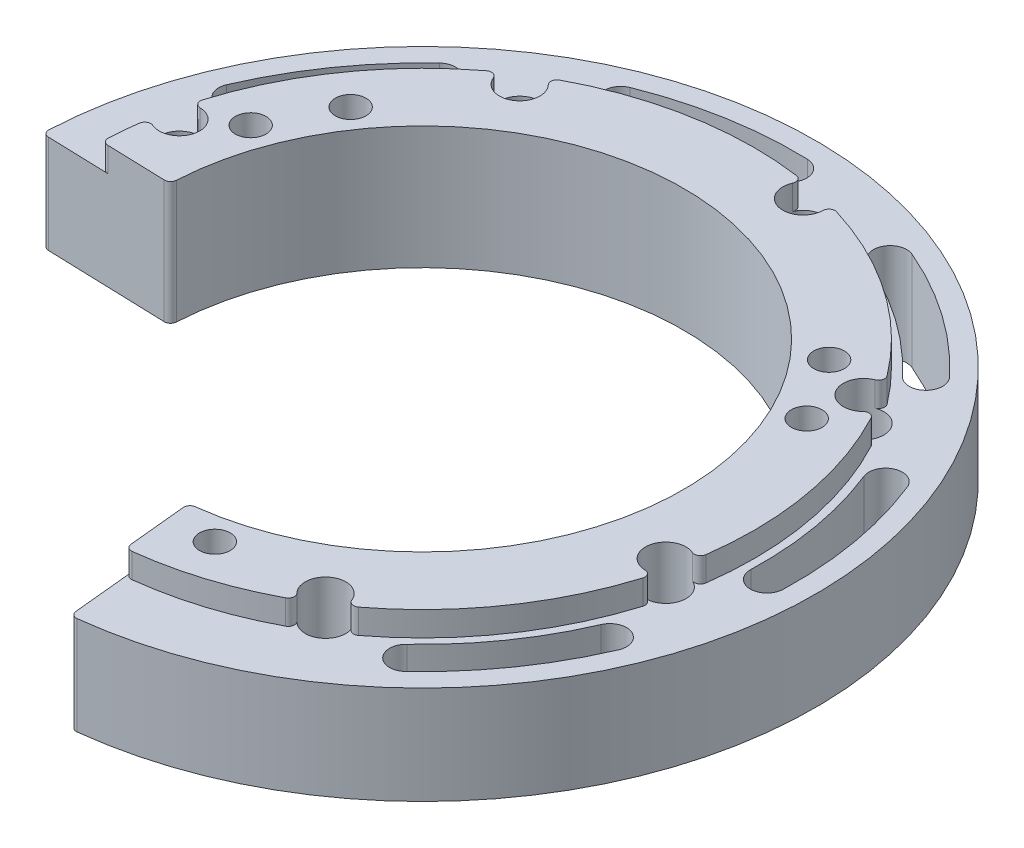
ISO-10303-21;
HEADER;
FILE_DESCRIPTION(('STEP AP214'),'2;1');
FILE_NAME('part.step','',(''),(''),'','','');
FILE_SCHEMA(('AUTOMOTIVE_DESIGN { 1 0 10303 214 1 1 1 1 }'));
ENDSEC;
DATA;
#1=APPLICATION_CONTEXT('core data for automotive mechanical design processes');
#2=APPLICATION_PROTOCOL_DEFINITION('international standard','automotive_design',2000,#1);
#3=PRODUCT_CONTEXT('',#1,'mechanical');
#4=PRODUCT('Part','Part','',(#3));
#5=PRODUCT_RELATED_PRODUCT_CATEGORY('part','',(#4));
#6=PRODUCT_DEFINITION_FORMATION('','',#4);
#7=PRODUCT_DEFINITION_CONTEXT('part definition',#1,'design');
#8=PRODUCT_DEFINITION('design','',#6,#7);
#9=PRODUCT_DEFINITION_SHAPE('','',#8);
#10=(LENGTH_UNIT() NAMED_UNIT(*) SI_UNIT(.MILLI.,.METRE.));
#11=(NAMED_UNIT(*) PLANE_ANGLE_UNIT() SI_UNIT($,.RADIAN.));
#12=(NAMED_UNIT(*) SI_UNIT($,.STERADIAN.) SOLID_ANGLE_UNIT());
#13=UNCERTAINTY_MEASURE_WITH_UNIT(LENGTH_MEASURE(1.E-05),#10,'distance_accuracy_value','');
#14=(GEOMETRIC_REPRESENTATION_CONTEXT(3) GLOBAL_UNCERTAINTY_ASSIGNED_CONTEXT((#13)) GLOBAL_UNIT_ASSIGNED_CONTEXT((#10,
#11,#12)) REPRESENTATION_CONTEXT('',''));
#15=CARTESIAN_POINT('',(0.,0.,0.));
#16=DIRECTION('',(0.,0.,1.));
#17=DIRECTION('',(1.,0.,0.));
#18=AXIS2_PLACEMENT_3D('',#15,#16,#17);
#19=CARTESIAN_POINT('',(1026.51465111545,941.990425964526,1022.62067815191));
#20=DIRECTION('',(0.,1.,0.));
#21=DIRECTION('',(0.7192538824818,0.,0.694747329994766));
#22=AXIS2_PLACEMENT_3D('',#19,#20,#21);
#23=CYLINDRICAL_SURFACE('',#22,27.);
#24=CARTESIAN_POINT('',(1026.51465111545,1014.36700558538,1022.62067815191));
#25=DIRECTION('',(0.,1.,0.));
#26=DIRECTION('',(0.7192538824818,0.,0.694747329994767));
#27=AXIS2_PLACEMENT_3D('',#24,#25,#26);
#28=CIRCLE('',#27,27.);
#29=CARTESIAN_POINT('',(999.76760735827,1014.36700558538,1018.93345016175));
#30=VERTEX_POINT('',#29);
#31=CARTESIAN_POINT('',(999.549277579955,1014.36700558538,1021.25369969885));
#32=VERTEX_POINT('',#31);
#33=EDGE_CURVE('E539',#30,#32,#28,.T.);
#34=ORIENTED_EDGE('',*,*,#33,.F.);
#35=DIRECTION('',(0.,-1.,0.));
#36=VECTOR('',#35,1.);
#37=CARTESIAN_POINT('',(999.76760735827,941.990425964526,1018.93345016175));
#38=LINE('',#37,#36);
#39=CARTESIAN_POINT('',(999.76760735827,1012.36700558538,1018.93345016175));
#40=VERTEX_POINT('',#39);
#41=EDGE_CURVE('E11',#30,#40,#38,.T.);
#42=ORIENTED_EDGE('',*,*,#41,.T.);
#43=CARTESIAN_POINT('',(1026.51465111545,1012.36700558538,1022.62067815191));
#44=DIRECTION('',(0.,1.,0.));
#45=DIRECTION('',(-0.7192538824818,0.,-0.694747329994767));
#46=AXIS2_PLACEMENT_3D('',#43,#44,#45);
#47=CIRCLE('',#46,27.);
#48=CARTESIAN_POINT('',(999.549277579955,1012.36700558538,1021.25369969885));
#49=VERTEX_POINT('',#48);
#50=EDGE_CURVE('E956',#40,#49,#47,.T.);
#51=ORIENTED_EDGE('',*,*,#50,.T.);
#52=DIRECTION('',(0.,1.,0.));
#53=VECTOR('',#52,1.);
#54=CARTESIAN_POINT('',(999.549277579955,941.990425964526,1021.25369969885));
#55=LINE('',#54,#53);
#56=EDGE_CURVE('E747',#49,#32,#55,.T.);
#57=ORIENTED_EDGE('',*,*,#56,.T.);
#58=EDGE_LOOP('',(#34,#42,#51,#57));
#59=FACE_BOUND('',#58,.T.);
#60=ADVANCED_FACE('F17',(#59),#23,.T.);
#61=CARTESIAN_POINT('',(1026.51465111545,941.990425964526,1022.62067815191));
#62=DIRECTION('',(0.,1.,0.));
#63=DIRECTION('',(0.7192538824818,0.,0.694747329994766));
#64=AXIS2_PLACEMENT_3D('',#61,#62,#63);
#65=CYLINDRICAL_SURFACE('',#64,27.);
#66=CARTESIAN_POINT('',(1026.51465111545,1014.36700558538,1022.62067815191));
#67=DIRECTION('',(0.,1.,0.));
#68=DIRECTION('',(0.7192538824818,0.,0.694747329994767));
#69=AXIS2_PLACEMENT_3D('',#66,#67,#68);
#70=CIRCLE('',#69,27.);
#71=CARTESIAN_POINT('',(1053.26169487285,1014.36700558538,1026.30790614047));
#72=VERTEX_POINT('',#71);
#73=CARTESIAN_POINT('',(1050.34984597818,1014.36700558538,1009.9366927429));
#74=VERTEX_POINT('',#73);
#75=EDGE_CURVE('E1013',#72,#74,#70,.T.);
#76=ORIENTED_EDGE('',*,*,#75,.F.);
#77=DIRECTION('',(0.,-1.,0.));
#78=VECTOR('',#77,1.);
#79=CARTESIAN_POINT('',(1053.26169487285,941.990425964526,1026.30790614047));
#80=LINE('',#79,#78);
#81=CARTESIAN_POINT('',(1053.26169487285,1012.36700558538,1026.30790614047));
#82=VERTEX_POINT('',#81);
#83=EDGE_CURVE('E525',#72,#82,#80,.T.);
#84=ORIENTED_EDGE('',*,*,#83,.T.);
#85=CARTESIAN_POINT('',(1026.51465111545,1012.36700558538,1022.62067815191));
#86=DIRECTION('',(0.,1.,0.));
#87=DIRECTION('',(-0.7192538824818,0.,-0.694747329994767));
#88=AXIS2_PLACEMENT_3D('',#85,#86,#87);
#89=CIRCLE('',#88,27.);
#90=CARTESIAN_POINT('',(1050.34984597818,1012.36700558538,1009.9366927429));
#91=VERTEX_POINT('',#90);
#92=EDGE_CURVE('E522',#82,#91,#89,.T.);
#93=ORIENTED_EDGE('',*,*,#92,.T.);
#94=DIRECTION('',(0.,1.,0.));
#95=VECTOR('',#94,1.);
#96=CARTESIAN_POINT('',(1050.34984597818,941.990425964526,1009.9366927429));
#97=LINE('',#96,#95);
#98=EDGE_CURVE('E554',#91,#74,#97,.T.);
#99=ORIENTED_EDGE('',*,*,#98,.T.);
#100=EDGE_LOOP('',(#76,#84,#93,#99));
#101=FACE_BOUND('',#100,.T.);
#102=ADVANCED_FACE('F19',(#101),#65,.T.);
#103=CARTESIAN_POINT('',(1026.51465111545,941.990425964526,1022.62067815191));
#104=DIRECTION('',(0.,1.,0.));
#105=DIRECTION('',(0.7192538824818,0.,0.694747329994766));
#106=AXIS2_PLACEMENT_3D('',#103,#104,#105);
#107=CYLINDRICAL_SURFACE('',#106,27.);
#108=CARTESIAN_POINT('',(1026.51465111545,1014.36700558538,1022.62067815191));
#109=DIRECTION('',(0.,1.,0.));
#110=DIRECTION('',(0.7192538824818,0.,0.694747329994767));
#111=AXIS2_PLACEMENT_3D('',#108,#109,#110);
#112=CIRCLE('',#111,27.);
#113=CARTESIAN_POINT('',(1048.03493104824,1014.36700558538,1006.31492604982));
#114=VERTEX_POINT('',#113);
#115=CARTESIAN_POINT('',(1034.39974693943,1014.36700558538,996.797718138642));
#116=VERTEX_POINT('',#115);
#117=EDGE_CURVE('E1016',#114,#116,#112,.T.);
#118=ORIENTED_EDGE('',*,*,#117,.F.);
#119=DIRECTION('',(0.,-1.,0.));
#120=VECTOR('',#119,1.);
#121=CARTESIAN_POINT('',(1048.03493104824,941.990425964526,1006.31492604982));
#122=LINE('',#121,#120);
#123=CARTESIAN_POINT('',(1048.03493104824,1012.36700558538,1006.31492604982));
#124=VERTEX_POINT('',#123);
#125=EDGE_CURVE('E647',#114,#124,#122,.T.);
#126=ORIENTED_EDGE('',*,*,#125,.T.);
#127=CARTESIAN_POINT('',(1026.51465111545,1012.36700558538,1022.62067815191));
#128=DIRECTION('',(0.,1.,0.));
#129=DIRECTION('',(-0.7192538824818,0.,-0.694747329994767));
#130=AXIS2_PLACEMENT_3D('',#127,#128,#129);
#131=CIRCLE('',#130,27.);
#132=CARTESIAN_POINT('',(1034.39974693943,1012.36700558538,996.797718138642));
#133=VERTEX_POINT('',#132);
#134=EDGE_CURVE('E963',#124,#133,#131,.T.);
#135=ORIENTED_EDGE('',*,*,#134,.T.);
#136=DIRECTION('',(0.,1.,0.));
#137=VECTOR('',#136,1.);
#138=CARTESIAN_POINT('',(1034.39974693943,941.990425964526,996.797718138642));
#139=LINE('',#138,#137);
#140=EDGE_CURVE('E624',#133,#116,#139,.T.);
#141=ORIENTED_EDGE('',*,*,#140,.T.);
#142=EDGE_LOOP('',(#118,#126,#135,#141));
#143=FACE_BOUND('',#142,.T.);
#144=ADVANCED_FACE('F1267',(#143),#107,.T.);
#145=CARTESIAN_POINT('',(1026.51465111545,941.990425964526,1022.62067815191));
#146=DIRECTION('',(0.,1.,0.));
#147=DIRECTION('',(0.7192538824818,0.,0.694747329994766));
#148=AXIS2_PLACEMENT_3D('',#145,#146,#147);
#149=CYLINDRICAL_SURFACE('',#148,27.);
#150=CARTESIAN_POINT('',(1026.51465111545,1014.36700558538,1022.62067815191));
#151=DIRECTION('',(0.,1.,0.));
#152=DIRECTION('',(0.7192538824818,0.,0.694747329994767));
#153=AXIS2_PLACEMENT_3D('',#150,#151,#152);
#154=CIRCLE('',#153,27.);
#155=CARTESIAN_POINT('',(1030.2018791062,1014.36700558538,995.873634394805));
#156=VERTEX_POINT('',#155);
#157=CARTESIAN_POINT('',(1013.83066570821,1014.36700558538,998.785483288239));
#158=VERTEX_POINT('',#157);
#159=EDGE_CURVE('E895',#156,#158,#154,.T.);
#160=ORIENTED_EDGE('',*,*,#159,.F.);
#161=DIRECTION('',(0.,-1.,0.));
#162=VECTOR('',#161,1.);
#163=CARTESIAN_POINT('',(1030.2018791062,941.990425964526,995.873634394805));
#164=LINE('',#163,#162);
#165=CARTESIAN_POINT('',(1030.2018791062,1012.36700558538,995.873634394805));
#166=VERTEX_POINT('',#165);
#167=EDGE_CURVE('E613',#156,#166,#164,.T.);
#168=ORIENTED_EDGE('',*,*,#167,.T.);
#169=CARTESIAN_POINT('',(1026.51465111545,1012.36700558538,1022.62067815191));
#170=DIRECTION('',(0.,1.,0.));
#171=DIRECTION('',(-0.7192538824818,0.,-0.694747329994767));
#172=AXIS2_PLACEMENT_3D('',#169,#170,#171);
#173=CIRCLE('',#172,27.);
#174=CARTESIAN_POINT('',(1013.83066570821,1012.36700558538,998.785483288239));
#175=VERTEX_POINT('',#174);
#176=EDGE_CURVE('E962',#166,#175,#173,.T.);
#177=ORIENTED_EDGE('',*,*,#176,.T.);
#178=DIRECTION('',(0.,1.,0.));
#179=VECTOR('',#178,1.);
#180=CARTESIAN_POINT('',(1013.83066570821,941.990425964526,998.785483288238));
#181=LINE('',#180,#179);
#182=EDGE_CURVE('E692',#175,#158,#181,.T.);
#183=ORIENTED_EDGE('',*,*,#182,.T.);
#184=EDGE_LOOP('',(#160,#168,#177,#183));
#185=FACE_BOUND('',#184,.T.);
#186=ADVANCED_FACE('F1225',(#185),#149,.T.);
#187=CARTESIAN_POINT('',(1026.51465111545,941.990425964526,1022.62067815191));
#188=DIRECTION('',(0.,1.,0.));
#189=DIRECTION('',(0.7192538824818,0.,0.694747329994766));
#190=AXIS2_PLACEMENT_3D('',#187,#188,#189);
#191=CYLINDRICAL_SURFACE('',#190,27.);
#192=CARTESIAN_POINT('',(1026.51465111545,1014.36700558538,1022.62067815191));
#193=DIRECTION('',(0.,1.,0.));
#194=DIRECTION('',(0.7192538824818,0.,0.694747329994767));
#195=AXIS2_PLACEMENT_3D('',#192,#193,#194);
#196=CIRCLE('',#195,27.);
#197=CARTESIAN_POINT('',(1010.20889901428,1014.36700558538,1001.10039821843));
#198=VERTEX_POINT('',#197);
#199=CARTESIAN_POINT('',(1000.69169110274,1014.36700558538,1014.73558232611));
#200=VERTEX_POINT('',#199);
#201=EDGE_CURVE('E543',#198,#200,#196,.T.);
#202=ORIENTED_EDGE('',*,*,#201,.F.);
#203=DIRECTION('',(0.,-1.,0.));
#204=VECTOR('',#203,1.);
#205=CARTESIAN_POINT('',(1010.20889901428,941.990425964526,1001.10039821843));
#206=LINE('',#205,#204);
#207=CARTESIAN_POINT('',(1010.20889901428,1012.36700558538,1001.10039821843));
#208=VERTEX_POINT('',#207);
#209=EDGE_CURVE('E658',#198,#208,#206,.T.);
#210=ORIENTED_EDGE('',*,*,#209,.T.);
#211=CARTESIAN_POINT('',(1026.51465111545,1012.36700558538,1022.62067815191));
#212=DIRECTION('',(0.,1.,0.));
#213=DIRECTION('',(-0.7192538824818,0.,-0.694747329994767));
#214=AXIS2_PLACEMENT_3D('',#211,#212,#213);
#215=CIRCLE('',#214,27.);
#216=CARTESIAN_POINT('',(1000.69169110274,1012.36700558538,1014.73558232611));
#217=VERTEX_POINT('',#216);
#218=EDGE_CURVE('E959',#208,#217,#215,.T.);
#219=ORIENTED_EDGE('',*,*,#218,.T.);
#220=DIRECTION('',(0.,1.,0.));
#221=VECTOR('',#220,1.);
#222=CARTESIAN_POINT('',(1000.69169110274,941.990425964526,1014.73558232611));
#223=LINE('',#222,#221);
#224=EDGE_CURVE('E591',#217,#200,#223,.T.);
#225=ORIENTED_EDGE('',*,*,#224,.T.);
#226=EDGE_LOOP('',(#202,#210,#219,#225));
#227=FACE_BOUND('',#226,.T.);
#228=ADVANCED_FACE('F1239',(#227),#191,.T.);
#229=CARTESIAN_POINT('',(1026.51465111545,941.990425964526,1022.62067815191));
#230=DIRECTION('',(0.,1.,0.));
#231=DIRECTION('',(0.7192538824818,0.,0.694747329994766));
#232=AXIS2_PLACEMENT_3D('',#229,#230,#231);
#233=CYLINDRICAL_SURFACE('',#232,27.);
#234=DIRECTION('',(0.,1.,0.));
#235=VECTOR('',#234,1.);
#236=CARTESIAN_POINT('',(1052.33761112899,941.990425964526,1030.50577397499));
#237=LINE('',#236,#235);
#238=CARTESIAN_POINT('',(1052.33761112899,1012.36700558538,1030.50577397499));
#239=VERTEX_POINT('',#238);
#240=CARTESIAN_POINT('',(1052.33761112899,1014.36700558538,1030.50577397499));
#241=VERTEX_POINT('',#240);
#242=EDGE_CURVE('E563',#239,#241,#237,.T.);
#243=ORIENTED_EDGE('',*,*,#242,.T.);
#244=CARTESIAN_POINT('',(1026.51465111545,1014.36700558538,1022.62067815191));
#245=DIRECTION('',(0.,1.,0.));
#246=DIRECTION('',(0.7192538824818,0.,0.694747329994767));
#247=AXIS2_PLACEMENT_3D('',#244,#245,#246);
#248=CIRCLE('',#247,27.);
#249=CARTESIAN_POINT('',(1042.82040321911,1014.36700558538,1044.1409580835));
#250=VERTEX_POINT('',#249);
#251=EDGE_CURVE('E771',#250,#241,#248,.T.);
#252=ORIENTED_EDGE('',*,*,#251,.F.);
#253=DIRECTION('',(0.,-1.,0.));
#254=VECTOR('',#253,1.);
#255=CARTESIAN_POINT('',(1042.82040321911,941.990425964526,1044.1409580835));
#256=LINE('',#255,#254);
#257=CARTESIAN_POINT('',(1042.82040321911,1012.36700558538,1044.1409580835));
#258=VERTEX_POINT('',#257);
#259=EDGE_CURVE('E782',#250,#258,#256,.T.);
#260=ORIENTED_EDGE('',*,*,#259,.T.);
#261=CARTESIAN_POINT('',(1026.51465111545,1012.36700558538,1022.62067815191));
#262=DIRECTION('',(0.,1.,0.));
#263=DIRECTION('',(-0.7192538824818,0.,-0.694747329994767));
#264=AXIS2_PLACEMENT_3D('',#261,#262,#263);
#265=CIRCLE('',#264,27.);
#266=EDGE_CURVE('E968',#258,#239,#265,.T.);
#267=ORIENTED_EDGE('',*,*,#266,.T.);
#268=EDGE_LOOP('',(#243,#252,#260,#267));
#269=FACE_BOUND('',#268,.T.);
#270=ADVANCED_FACE('F1365',(#269),#233,.T.);
#271=CARTESIAN_POINT('',(995.0504127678,1095.77628513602,1021.12010985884));
#272=DIRECTION('',(0.,-1.,0.));
#273=DIRECTION('',(-0.719253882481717,0.,-0.694747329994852));
#274=AXIS2_PLACEMENT_3D('',#271,#272,#273);
#275=CYLINDRICAL_SURFACE('',#274,0.500000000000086);
#276=CARTESIAN_POINT('',(995.0504127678,1012.36700558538,1021.12010985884));
#277=DIRECTION('',(0.,1.,0.));
#278=DIRECTION('',(-0.719253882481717,0.,-0.694747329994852));
#279=AXIS2_PLACEMENT_3D('',#276,#277,#278);
#280=CIRCLE('',#279,0.500000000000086);
#281=CARTESIAN_POINT('',(994.550980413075,1012.36700558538,1021.09629131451));
#282=VERTEX_POINT('',#281);
#283=CARTESIAN_POINT('',(995.034524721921,1012.36700558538,1021.61985736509));
#284=VERTEX_POINT('',#283);
#285=EDGE_CURVE('E978',#282,#284,#280,.T.);
#286=ORIENTED_EDGE('',*,*,#285,.F.);
#287=DIRECTION('',(0.,1.,0.));
#288=VECTOR('',#287,1.);
#289=CARTESIAN_POINT('',(994.550980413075,1095.77628513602,1021.09629131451));
#290=LINE('',#289,#288);
#291=CARTESIAN_POINT('',(994.550980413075,1004.36700558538,1021.09629131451));
#292=VERTEX_POINT('',#291);
#293=EDGE_CURVE('E21',#292,#282,#290,.T.);
#294=ORIENTED_EDGE('',*,*,#293,.F.);
#295=CARTESIAN_POINT('',(995.0504127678,1004.36700558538,1021.12010985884));
#296=DIRECTION('',(0.,-1.,0.));
#297=DIRECTION('',(-0.719253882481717,0.,-0.694747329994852));
#298=AXIS2_PLACEMENT_3D('',#295,#296,#297);
#299=CIRCLE('',#298,0.500000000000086);
#300=CARTESIAN_POINT('',(995.034524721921,1004.36700558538,1021.61985736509));
#301=VERTEX_POINT('',#300);
#302=EDGE_CURVE('E2658',#301,#292,#299,.T.);
#303=ORIENTED_EDGE('',*,*,#302,.F.);
#304=DIRECTION('',(0.,-1.,0.));
#305=VECTOR('',#304,1.);
#306=CARTESIAN_POINT('',(995.034524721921,1061.42016868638,1021.61985736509));
#307=LINE('',#306,#305);
#308=EDGE_CURVE('E1027',#284,#301,#307,.T.);
#309=ORIENTED_EDGE('',*,*,#308,.F.);
#310=EDGE_LOOP('',(#286,#294,#303,#309));
#311=FACE_BOUND('',#310,.T.);
#312=ADVANCED_FACE('F1081',(#311),#275,.T.);
#313=CARTESIAN_POINT('',(1029.15143454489,1012.36700558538,1044.21025603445));
#314=DIRECTION('',(0.,1.,0.));
#315=DIRECTION('',(0.719253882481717,0.,0.694747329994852));
#316=AXIS2_PLACEMENT_3D('',#313,#314,#315);
#317=CYLINDRICAL_SURFACE('',#316,0.500000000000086);
#318=CARTESIAN_POINT('',(1029.15143454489,1014.36700558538,1044.21025603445));
#319=DIRECTION('',(0.,1.,0.));
#320=DIRECTION('',(-0.719253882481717,0.,-0.694747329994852));
#321=AXIS2_PLACEMENT_3D('',#318,#319,#320);
#322=CIRCLE('',#321,0.500000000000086);
#323=CARTESIAN_POINT('',(1029.09081883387,1014.36700558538,1043.71394389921));
#324=VERTEX_POINT('',#323);
#325=CARTESIAN_POINT('',(1028.65386010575,1014.36700558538,1044.25944625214));
#326=VERTEX_POINT('',#325);
#327=EDGE_CURVE('E766',#324,#326,#322,.T.);
#328=ORIENTED_EDGE('',*,*,#327,.F.);
#329=DIRECTION('',(0.,1.,0.));
#330=VECTOR('',#329,1.);
#331=CARTESIAN_POINT('',(1029.09081883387,1012.36700558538,1043.71394389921));
#332=LINE('',#331,#330);
#333=CARTESIAN_POINT('',(1029.09081883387,1004.36700558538,1043.71394389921));
#334=VERTEX_POINT('',#333);
#335=EDGE_CURVE('E724',#334,#324,#332,.T.);
#336=ORIENTED_EDGE('',*,*,#335,.F.);
#337=CARTESIAN_POINT('',(1029.15143454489,1004.36700558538,1044.21025603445));
#338=DIRECTION('',(0.,-1.,0.));
#339=DIRECTION('',(-0.719253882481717,0.,-0.694747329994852));
#340=AXIS2_PLACEMENT_3D('',#337,#338,#339);
#341=CIRCLE('',#340,0.500000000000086);
#342=CARTESIAN_POINT('',(1028.65386010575,1004.36700558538,1044.25944625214));
#343=VERTEX_POINT('',#342);
#344=EDGE_CURVE('E1126',#343,#334,#341,.T.);
#345=ORIENTED_EDGE('',*,*,#344,.F.);
#346=DIRECTION('',(0.,-1.,0.));
#347=VECTOR('',#346,1.);
#348=CARTESIAN_POINT('',(1028.65386010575,1006.36700558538,1044.25944625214));
#349=LINE('',#348,#347);
#350=EDGE_CURVE('E40',#326,#343,#349,.T.);
#351=ORIENTED_EDGE('',*,*,#350,.F.);
#352=EDGE_LOOP('',(#328,#336,#345,#351));
#353=FACE_BOUND('',#352,.T.);
#354=ADVANCED_FACE('F2081',(#353),#317,.T.);
#355=CARTESIAN_POINT('',(1030.11081884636,1095.77628513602,1053.91472834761));
#356=DIRECTION('',(0.,-1.,0.));
#357=DIRECTION('',(-0.719253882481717,0.,-0.694747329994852));
#358=AXIS2_PLACEMENT_3D('',#355,#356,#357);
#359=CYLINDRICAL_SURFACE('',#358,0.500000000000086);
#360=CARTESIAN_POINT('',(1030.11081884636,1012.36700558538,1053.91472834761));
#361=DIRECTION('',(0.,1.,0.));
#362=DIRECTION('',(-0.719253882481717,0.,-0.694747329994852));
#363=AXIS2_PLACEMENT_3D('',#360,#361,#362);
#364=CIRCLE('',#363,0.500000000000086);
#365=CARTESIAN_POINT('',(1029.61324440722,1012.36700558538,1053.96391856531));
#366=VERTEX_POINT('',#365);
#367=CARTESIAN_POINT('',(1030.16790087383,1012.36700558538,1054.4114593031));
#368=VERTEX_POINT('',#367);
#369=EDGE_CURVE('E975',#366,#368,#364,.T.);
#370=ORIENTED_EDGE('',*,*,#369,.F.);
#371=DIRECTION('',(0.,1.,0.));
#372=VECTOR('',#371,1.);
#373=CARTESIAN_POINT('',(1029.61324440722,1012.36700558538,1053.96391856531));
#374=LINE('',#373,#372);
#375=CARTESIAN_POINT('',(1029.61324440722,1004.36700558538,1053.96391856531));
#376=VERTEX_POINT('',#375);
#377=EDGE_CURVE('E1035',#376,#366,#374,.T.);
#378=ORIENTED_EDGE('',*,*,#377,.F.);
#379=CARTESIAN_POINT('',(1030.11081884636,1004.36700558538,1053.91472834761));
#380=DIRECTION('',(0.,-1.,0.));
#381=DIRECTION('',(-0.719253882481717,0.,-0.694747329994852));
#382=AXIS2_PLACEMENT_3D('',#379,#380,#381);
#383=CIRCLE('',#382,0.500000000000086);
#384=CARTESIAN_POINT('',(1030.16790087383,1004.36700558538,1054.4114593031));
#385=VERTEX_POINT('',#384);
#386=EDGE_CURVE('E1114',#385,#376,#383,.T.);
#387=ORIENTED_EDGE('',*,*,#386,.F.);
#388=DIRECTION('',(0.,-1.,0.));
#389=VECTOR('',#388,1.);
#390=CARTESIAN_POINT('',(1030.16790087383,1095.77628513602,1054.4114593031));
#391=LINE('',#390,#389);
#392=EDGE_CURVE('E910',#368,#385,#391,.T.);
#393=ORIENTED_EDGE('',*,*,#392,.F.);
#394=EDGE_LOOP('',(#370,#378,#387,#393));
#395=FACE_BOUND('',#394,.T.);
#396=ADVANCED_FACE('F1381',(#395),#359,.T.);
#397=CARTESIAN_POINT('',(1053.17369010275,1006.36700558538,1034.03538972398));
#398=DIRECTION('',(0.,1.,0.));
#399=DIRECTION('',(0.719253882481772,0.,0.694747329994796));
#400=AXIS2_PLACEMENT_3D('',#397,#398,#399);
#401=CYLINDRICAL_SURFACE('',#400,1.35992500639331);
#402=CARTESIAN_POINT('',(1053.17369010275,1012.36700558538,1034.03538972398));
#403=DIRECTION('',(0.,1.,0.));
#404=DIRECTION('',(0.719253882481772,0.,0.694747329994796));
#405=AXIS2_PLACEMENT_3D('',#402,#403,#404);
#406=CIRCLE('',#405,1.35992500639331);
#407=CARTESIAN_POINT('',(1054.42383816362,1012.36700558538,1034.57067081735));
#408=VERTEX_POINT('',#407);
#409=CARTESIAN_POINT('',(1051.92354204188,1012.36700558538,1033.50010863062));
#410=VERTEX_POINT('',#409);
#411=EDGE_CURVE('E982',#408,#410,#406,.T.);
#412=ORIENTED_EDGE('',*,*,#411,.T.);
#413=DIRECTION('',(0.,1.,0.));
#414=VECTOR('',#413,1.);
#415=CARTESIAN_POINT('',(1051.92354204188,1006.36700558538,1033.50010863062));
#416=LINE('',#415,#414);
#417=CARTESIAN_POINT('',(1051.92354204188,1004.36700558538,1033.50010863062));
#418=VERTEX_POINT('',#417);
#419=EDGE_CURVE('E584',#418,#410,#416,.T.);
#420=ORIENTED_EDGE('',*,*,#419,.F.);
#421=CARTESIAN_POINT('',(1053.17369010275,1004.36700558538,1034.03538972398));
#422=DIRECTION('',(0.,-1.,0.));
#423=DIRECTION('',(-0.719253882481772,0.,-0.694747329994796));
#424=AXIS2_PLACEMENT_3D('',#421,#422,#423);
#425=CIRCLE('',#424,1.35992500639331);
#426=CARTESIAN_POINT('',(1054.42383816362,1004.36700558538,1034.57067081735));
#427=VERTEX_POINT('',#426);
#428=EDGE_CURVE('E544',#418,#427,#425,.T.);
#429=ORIENTED_EDGE('',*,*,#428,.T.);
#430=DIRECTION('',(0.,1.,0.));
#431=VECTOR('',#430,1.);
#432=CARTESIAN_POINT('',(1054.42383816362,1006.36700558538,1034.57067081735));
#433=LINE('',#432,#431);
#434=EDGE_CURVE('E1060',#427,#408,#433,.T.);
#435=ORIENTED_EDGE('',*,*,#434,.T.);
#436=EDGE_LOOP('',(#412,#420,#429,#435));
#437=FACE_BOUND('',#436,.T.);
#438=ADVANCED_FACE('F1283',(#437),#401,.F.);
#439=CARTESIAN_POINT('',(1046.34615619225,1006.36700558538,1043.7798701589));
#440=DIRECTION('',(0.,1.,0.));
#441=DIRECTION('',(0.719253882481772,0.,0.694747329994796));
#442=AXIS2_PLACEMENT_3D('',#439,#440,#441);
#443=CYLINDRICAL_SURFACE('',#442,1.35992500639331);
#444=CARTESIAN_POINT('',(1046.34615619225,1012.36700558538,1043.7798701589));
#445=DIRECTION('',(0.,1.,0.));
#446=DIRECTION('',(0.719253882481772,0.,0.694747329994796));
#447=AXIS2_PLACEMENT_3D('',#444,#445,#446);
#448=CIRCLE('',#447,1.35992500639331);
#449=CARTESIAN_POINT('',(1045.41617827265,1012.36700558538,1042.78763173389));
#450=VERTEX_POINT('',#449);
#451=CARTESIAN_POINT('',(1047.27613411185,1012.36700558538,1044.77210858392));
#452=VERTEX_POINT('',#451);
#453=EDGE_CURVE('E884',#450,#452,#448,.T.);
#454=ORIENTED_EDGE('',*,*,#453,.T.);
#455=DIRECTION('',(0.,1.,0.));
#456=VECTOR('',#455,1.);
#457=CARTESIAN_POINT('',(1047.27613411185,1006.36700558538,1044.77210858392));
#458=LINE('',#457,#456);
#459=CARTESIAN_POINT('',(1047.27613411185,1004.36700558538,1044.77210858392));
#460=VERTEX_POINT('',#459);
#461=EDGE_CURVE('E832',#460,#452,#458,.T.);
#462=ORIENTED_EDGE('',*,*,#461,.F.);
#463=CARTESIAN_POINT('',(1046.34615619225,1004.36700558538,1043.7798701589));
#464=DIRECTION('',(0.,-1.,0.));
#465=DIRECTION('',(-0.719253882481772,0.,-0.694747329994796));
#466=AXIS2_PLACEMENT_3D('',#463,#464,#465);
#467=CIRCLE('',#466,1.35992500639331);
#468=CARTESIAN_POINT('',(1045.41617827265,1004.36700558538,1042.78763173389));
#469=VERTEX_POINT('',#468);
#470=EDGE_CURVE('E1190',#460,#469,#467,.T.);
#471=ORIENTED_EDGE('',*,*,#470,.T.);
#472=DIRECTION('',(0.,1.,0.));
#473=VECTOR('',#472,1.);
#474=CARTESIAN_POINT('',(1045.41617827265,1006.36700558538,1042.78763173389));
#475=LINE('',#474,#473);
#476=EDGE_CURVE('E1057',#469,#450,#475,.T.);
#477=ORIENTED_EDGE('',*,*,#476,.T.);
#478=EDGE_LOOP('',(#454,#462,#471,#477));
#479=FACE_BOUND('',#478,.T.);
#480=ADVANCED_FACE('F1279',(#479),#443,.F.);
#481=CARTESIAN_POINT('',(1026.51465111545,1006.36700558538,1022.62067815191));
#482=DIRECTION('',(0.,1.,0.));
#483=DIRECTION('',(0.719253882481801,0.,0.694747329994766));
#484=AXIS2_PLACEMENT_3D('',#481,#482,#483);
#485=CYLINDRICAL_SURFACE('',#484,30.359925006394);
#486=CARTESIAN_POINT('',(1026.51465111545,1012.36700558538,1022.62067815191));
#487=DIRECTION('',(0.,1.,0.));
#488=DIRECTION('',(0.719253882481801,0.,0.694747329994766));
#489=AXIS2_PLACEMENT_3D('',#486,#487,#488);
#490=CIRCLE('',#489,30.359925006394);
#491=CARTESIAN_POINT('',(1056.85866320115,1012.36700558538,1023.60351940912));
#492=VERTEX_POINT('',#491);
#493=CARTESIAN_POINT('',(1054.69934738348,1012.36700558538,1011.33582358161));
#494=VERTEX_POINT('',#493);
#495=EDGE_CURVE('E767',#492,#494,#490,.T.);
#496=ORIENTED_EDGE('',*,*,#495,.T.);
#497=DIRECTION('',(0.,1.,0.));
#498=VECTOR('',#497,1.);
#499=CARTESIAN_POINT('',(1054.69934738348,1006.36700558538,1011.33582358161));
#500=LINE('',#499,#498);
#501=CARTESIAN_POINT('',(1054.69934738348,1004.36700558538,1011.33582358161));
#502=VERTEX_POINT('',#501);
#503=EDGE_CURVE('E1038',#502,#494,#500,.T.);
#504=ORIENTED_EDGE('',*,*,#503,.F.);
#505=CARTESIAN_POINT('',(1026.51465111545,1004.36700558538,1022.62067815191));
#506=DIRECTION('',(0.,-1.,0.));
#507=DIRECTION('',(-0.719253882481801,0.,-0.694747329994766));
#508=AXIS2_PLACEMENT_3D('',#505,#506,#507);
#509=CIRCLE('',#508,30.359925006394);
#510=CARTESIAN_POINT('',(1056.85866320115,1004.36700558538,1023.60351940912));
#511=VERTEX_POINT('',#510);
#512=EDGE_CURVE('E604',#502,#511,#509,.T.);
#513=ORIENTED_EDGE('',*,*,#512,.T.);
#514=DIRECTION('',(0.,1.,0.));
#515=VECTOR('',#514,1.);
#516=CARTESIAN_POINT('',(1056.85866320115,1006.36700558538,1023.60351940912));
#517=LINE('',#516,#515);
#518=EDGE_CURVE('E1053',#511,#492,#517,.T.);
#519=ORIENTED_EDGE('',*,*,#518,.T.);
#520=EDGE_LOOP('',(#496,#504,#513,#519));
#521=FACE_BOUND('',#520,.T.);
#522=ADVANCED_FACE('F1282',(#521),#485,.F.);
#523=CARTESIAN_POINT('',(1053.43685832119,1006.36700558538,1011.84131086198));
#524=DIRECTION('',(0.,1.,0.));
#525=DIRECTION('',(0.719253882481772,0.,0.694747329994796));
#526=AXIS2_PLACEMENT_3D('',#523,#524,#525);
#527=CYLINDRICAL_SURFACE('',#526,1.35992500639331);
#528=CARTESIAN_POINT('',(1053.43685832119,1012.36700558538,1011.84131086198));
#529=DIRECTION('',(0.,1.,0.));
#530=DIRECTION('',(0.719253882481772,0.,0.694747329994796));
#531=AXIS2_PLACEMENT_3D('',#528,#529,#530);
#532=CIRCLE('',#531,1.35992500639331);
#533=CARTESIAN_POINT('',(1052.1743692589,1012.36700558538,1012.34679814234));
#534=VERTEX_POINT('',#533);
#535=EDGE_CURVE('E772',#494,#534,#532,.T.);
#536=ORIENTED_EDGE('',*,*,#535,.T.);
#537=DIRECTION('',(0.,1.,0.));
#538=VECTOR('',#537,1.);
#539=CARTESIAN_POINT('',(1052.1743692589,1006.36700558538,1012.34679814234));
#540=LINE('',#539,#538);
#541=CARTESIAN_POINT('',(1052.1743692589,1004.36700558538,1012.34679814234));
#542=VERTEX_POINT('',#541);
#543=EDGE_CURVE('E576',#542,#534,#540,.T.);
#544=ORIENTED_EDGE('',*,*,#543,.F.);
#545=CARTESIAN_POINT('',(1053.43685832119,1004.36700558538,1011.84131086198));
#546=DIRECTION('',(0.,-1.,0.));
#547=DIRECTION('',(-0.719253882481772,0.,-0.694747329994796));
#548=AXIS2_PLACEMENT_3D('',#545,#546,#547);
#549=CIRCLE('',#548,1.35992500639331);
#550=EDGE_CURVE('E581',#542,#502,#549,.T.);
#551=ORIENTED_EDGE('',*,*,#550,.T.);
#552=ORIENTED_EDGE('',*,*,#503,.T.);
#553=EDGE_LOOP('',(#536,#544,#551,#552));
#554=FACE_BOUND('',#553,.T.);
#555=ADVANCED_FACE('F1306',(#554),#527,.F.);
#556=CARTESIAN_POINT('',(1026.51465111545,1006.36700558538,1022.62067815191));
#557=DIRECTION('',(0.,1.,0.));
#558=DIRECTION('',(0.719253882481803,0.,0.694747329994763));
#559=AXIS2_PLACEMENT_3D('',#556,#557,#558);
#560=CYLINDRICAL_SURFACE('',#559,27.6400749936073);
#561=CARTESIAN_POINT('',(1026.51465111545,1012.36700558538,1022.62067815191));
#562=DIRECTION('',(0.,1.,0.));
#563=DIRECTION('',(0.719253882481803,0.,0.694747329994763));
#564=AXIS2_PLACEMENT_3D('',#561,#562,#563);
#565=CIRCLE('',#564,27.6400749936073);
#566=CARTESIAN_POINT('',(1054.14023877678,1012.36700558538,1023.51546975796));
#567=VERTEX_POINT('',#566);
#568=EDGE_CURVE('E941',#567,#534,#565,.T.);
#569=ORIENTED_EDGE('',*,*,#568,.F.);
#570=DIRECTION('',(0.,1.,0.));
#571=VECTOR('',#570,1.);
#572=CARTESIAN_POINT('',(1054.14023877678,1006.36700558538,1023.51546975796));
#573=LINE('',#572,#571);
#574=CARTESIAN_POINT('',(1054.14023877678,1004.36700558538,1023.51546975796));
#575=VERTEX_POINT('',#574);
#576=EDGE_CURVE('E839',#575,#567,#573,.T.);
#577=ORIENTED_EDGE('',*,*,#576,.F.);
#578=CARTESIAN_POINT('',(1026.51465111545,1004.36700558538,1022.62067815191));
#579=DIRECTION('',(0.,1.,0.));
#580=DIRECTION('',(-0.719253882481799,0.,-0.694747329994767));
#581=AXIS2_PLACEMENT_3D('',#578,#579,#580);
#582=CIRCLE('',#581,27.6400749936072);
#583=EDGE_CURVE('E594',#575,#542,#582,.T.);
#584=ORIENTED_EDGE('',*,*,#583,.T.);
#585=ORIENTED_EDGE('',*,*,#543,.T.);
#586=EDGE_LOOP('',(#569,#577,#584,#585));
#587=FACE_BOUND('',#586,.T.);
#588=ADVANCED_FACE('F1309',(#587),#560,.T.);
#589=CARTESIAN_POINT('',(1026.51465111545,1006.36700558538,1022.62067815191));
#590=DIRECTION('',(0.,1.,0.));
#591=DIRECTION('',(0.719253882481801,0.,0.694747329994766));
#592=AXIS2_PLACEMENT_3D('',#589,#590,#591);
#593=CYLINDRICAL_SURFACE('',#592,30.3599250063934);
#594=CARTESIAN_POINT('',(1026.51465111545,1012.36700558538,1022.62067815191));
#595=DIRECTION('',(0.,1.,0.));
#596=DIRECTION('',(0.719253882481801,0.,0.694747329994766));
#597=AXIS2_PLACEMENT_3D('',#594,#595,#596);
#598=CIRCLE('',#597,30.3599250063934);
#599=CARTESIAN_POINT('',(1048.66608154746,1012.36700558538,1001.85919515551));
#600=VERTEX_POINT('',#599);
#601=CARTESIAN_POINT('',(1038.4646437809,1012.36700558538,994.711491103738));
#602=VERTEX_POINT('',#601);
#603=EDGE_CURVE('E990',#600,#602,#598,.T.);
#604=ORIENTED_EDGE('',*,*,#603,.T.);
#605=DIRECTION('',(0.,1.,0.));
#606=VECTOR('',#605,1.);
#607=CARTESIAN_POINT('',(1038.4646437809,1006.36700558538,994.711491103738));
#608=LINE('',#607,#606);
#609=CARTESIAN_POINT('',(1038.4646437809,1004.36700558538,994.711491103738));
#610=VERTEX_POINT('',#609);
#611=EDGE_CURVE('E577',#610,#602,#608,.T.);
#612=ORIENTED_EDGE('',*,*,#611,.F.);
#613=CARTESIAN_POINT('',(1026.51465111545,1004.36700558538,1022.62067815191));
#614=DIRECTION('',(0.,-1.,0.));
#615=DIRECTION('',(-0.719253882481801,0.,-0.694747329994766));
#616=AXIS2_PLACEMENT_3D('',#613,#614,#615);
#617=CIRCLE('',#616,30.3599250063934);
#618=CARTESIAN_POINT('',(1048.66608154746,1004.36700558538,1001.85919515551));
#619=VERTEX_POINT('',#618);
#620=EDGE_CURVE('E632',#610,#619,#617,.T.);
#621=ORIENTED_EDGE('',*,*,#620,.T.);
#622=DIRECTION('',(0.,1.,0.));
#623=VECTOR('',#622,1.);
#624=CARTESIAN_POINT('',(1048.66608154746,1006.36700558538,1001.85919515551));
#625=LINE('',#624,#623);
#626=EDGE_CURVE('E572',#619,#600,#625,.T.);
#627=ORIENTED_EDGE('',*,*,#626,.T.);
#628=EDGE_LOOP('',(#604,#612,#621,#627));
#629=FACE_BOUND('',#628,.T.);
#630=ADVANCED_FACE('F1723',(#629),#593,.F.);
#631=CARTESIAN_POINT('',(1037.92936268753,1006.36700558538,995.961639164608));
#632=DIRECTION('',(0.,1.,0.));
#633=DIRECTION('',(0.719253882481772,0.,0.694747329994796));
#634=AXIS2_PLACEMENT_3D('',#631,#632,#633);
#635=CYLINDRICAL_SURFACE('',#634,1.35992500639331);
#636=CARTESIAN_POINT('',(1037.92936268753,1012.36700558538,995.961639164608));
#637=DIRECTION('',(0.,1.,0.));
#638=DIRECTION('',(0.719253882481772,0.,0.694747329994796));
#639=AXIS2_PLACEMENT_3D('',#636,#637,#638);
#640=CIRCLE('',#639,1.35992500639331);
#641=CARTESIAN_POINT('',(1037.39408159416,1012.36700558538,997.211787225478));
#642=VERTEX_POINT('',#641);
#643=EDGE_CURVE('E883',#602,#642,#640,.T.);
#644=ORIENTED_EDGE('',*,*,#643,.T.);
#645=DIRECTION('',(0.,1.,0.));
#646=VECTOR('',#645,1.);
#647=CARTESIAN_POINT('',(1037.39408159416,1006.36700558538,997.211787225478));
#648=LINE('',#647,#646);
#649=CARTESIAN_POINT('',(1037.39408159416,1004.36700558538,997.211787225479));
#650=VERTEX_POINT('',#649);
#651=EDGE_CURVE('E889',#650,#642,#648,.T.);
#652=ORIENTED_EDGE('',*,*,#651,.F.);
#653=CARTESIAN_POINT('',(1037.92936268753,1004.36700558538,995.961639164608));
#654=DIRECTION('',(0.,-1.,0.));
#655=DIRECTION('',(-0.719253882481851,0.,-0.694747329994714));
#656=AXIS2_PLACEMENT_3D('',#653,#654,#655);
#657=CIRCLE('',#656,1.35992500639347);
#658=EDGE_CURVE('E608',#650,#610,#657,.T.);
#659=ORIENTED_EDGE('',*,*,#658,.T.);
#660=ORIENTED_EDGE('',*,*,#611,.T.);
#661=EDGE_LOOP('',(#644,#652,#659,#660));
#662=FACE_BOUND('',#661,.T.);
#663=ADVANCED_FACE('F1735',(#662),#635,.F.);
#664=CARTESIAN_POINT('',(1026.51465111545,1006.36700558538,1022.62067815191));
#665=DIRECTION('',(0.,1.,0.));
#666=DIRECTION('',(0.7192538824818,0.,0.694747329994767));
#667=AXIS2_PLACEMENT_3D('',#664,#665,#666);
#668=CYLINDRICAL_SURFACE('',#667,27.6400749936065);
#669=CARTESIAN_POINT('',(1026.51465111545,1012.36700558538,1022.62067815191));
#670=DIRECTION('',(0.,1.,0.));
#671=DIRECTION('',(0.7192538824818,0.,0.694747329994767));
#672=AXIS2_PLACEMENT_3D('',#669,#670,#671);
#673=CIRCLE('',#672,27.6400749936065);
#674=CARTESIAN_POINT('',(1046.68160469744,1012.36700558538,1003.71915099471));
#675=VERTEX_POINT('',#674);
#676=EDGE_CURVE('E879',#675,#642,#673,.T.);
#677=ORIENTED_EDGE('',*,*,#676,.F.);
#678=DIRECTION('',(0.,1.,0.));
#679=VECTOR('',#678,1.);
#680=CARTESIAN_POINT('',(1046.68160469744,1006.36700558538,1003.71915099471));
#681=LINE('',#680,#679);
#682=CARTESIAN_POINT('',(1046.68160469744,1004.36700558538,1003.71915099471));
#683=VERTEX_POINT('',#682);
#684=EDGE_CURVE('E846',#683,#675,#681,.T.);
#685=ORIENTED_EDGE('',*,*,#684,.F.);
#686=CARTESIAN_POINT('',(1026.51465111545,1004.36700558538,1022.62067815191));
#687=DIRECTION('',(0.,1.,0.));
#688=DIRECTION('',(-0.7192538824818,0.,-0.694747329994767));
#689=AXIS2_PLACEMENT_3D('',#686,#687,#688);
#690=CIRCLE('',#689,27.6400749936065);
#691=EDGE_CURVE('E612',#683,#650,#690,.T.);
#692=ORIENTED_EDGE('',*,*,#691,.T.);
#693=ORIENTED_EDGE('',*,*,#651,.T.);
#694=EDGE_LOOP('',(#677,#685,#692,#693));
#695=FACE_BOUND('',#694,.T.);
#696=ADVANCED_FACE('F1328',(#695),#668,.T.);
#697=CARTESIAN_POINT('',(1026.51465111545,1006.36700558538,1022.62067815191));
#698=DIRECTION('',(0.,1.,0.));
#699=DIRECTION('',(0.719253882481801,0.,0.694747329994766));
#700=AXIS2_PLACEMENT_3D('',#697,#698,#699);
#701=CYLINDRICAL_SURFACE('',#700,30.3599250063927);
#702=CARTESIAN_POINT('',(1026.51465111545,1012.36700558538,1022.62067815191));
#703=DIRECTION('',(0.,1.,0.));
#704=DIRECTION('',(0.719253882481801,0.,0.694747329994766));
#705=AXIS2_PLACEMENT_3D('',#702,#703,#704);
#706=CIRCLE('',#705,30.3599250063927);
#707=CARTESIAN_POINT('',(1027.49749237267,1012.36700558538,992.276666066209));
#708=VERTEX_POINT('',#707);
#709=CARTESIAN_POINT('',(1015.22979654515,1012.36700558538,994.435981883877));
#710=VERTEX_POINT('',#709);
#711=EDGE_CURVE('E937',#708,#710,#706,.T.);
#712=ORIENTED_EDGE('',*,*,#711,.T.);
#713=DIRECTION('',(0.,1.,0.));
#714=VECTOR('',#713,1.);
#715=CARTESIAN_POINT('',(1015.22979654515,1006.36700558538,994.435981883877));
#716=LINE('',#715,#714);
#717=CARTESIAN_POINT('',(1015.22979654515,1004.36700558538,994.435981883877));
#718=VERTEX_POINT('',#717);
#719=EDGE_CURVE('E1043',#718,#710,#716,.T.);
#720=ORIENTED_EDGE('',*,*,#719,.F.);
#721=CARTESIAN_POINT('',(1026.51465111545,1004.36700558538,1022.62067815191));
#722=DIRECTION('',(0.,-1.,0.));
#723=DIRECTION('',(-0.719253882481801,0.,-0.694747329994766));
#724=AXIS2_PLACEMENT_3D('',#721,#722,#723);
#725=CIRCLE('',#724,30.3599250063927);
#726=CARTESIAN_POINT('',(1027.49749237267,1004.36700558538,992.276666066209));
#727=VERTEX_POINT('',#726);
#728=EDGE_CURVE('E679',#718,#727,#725,.T.);
#729=ORIENTED_EDGE('',*,*,#728,.T.);
#730=DIRECTION('',(0.,1.,0.));
#731=VECTOR('',#730,1.);
#732=CARTESIAN_POINT('',(1027.49749237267,1006.36700558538,992.276666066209));
#733=LINE('',#732,#731);
#734=EDGE_CURVE('E892',#727,#708,#733,.T.);
#735=ORIENTED_EDGE('',*,*,#734,.T.);
#736=EDGE_LOOP('',(#712,#720,#729,#735));
#737=FACE_BOUND('',#736,.T.);
#738=ADVANCED_FACE('F1324',(#737),#701,.F.);
#739=CARTESIAN_POINT('',(1015.73528382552,1006.36700558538,995.698470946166));
#740=DIRECTION('',(0.,1.,0.));
#741=DIRECTION('',(0.719253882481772,0.,0.694747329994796));
#742=AXIS2_PLACEMENT_3D('',#739,#740,#741);
#743=CYLINDRICAL_SURFACE('',#742,1.35992500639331);
#744=CARTESIAN_POINT('',(1015.73528382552,1012.36700558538,995.698470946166));
#745=DIRECTION('',(0.,1.,0.));
#746=DIRECTION('',(0.719253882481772,0.,0.694747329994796));
#747=AXIS2_PLACEMENT_3D('',#744,#745,#746);
#748=CIRCLE('',#747,1.35992500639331);
#749=CARTESIAN_POINT('',(1016.24077110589,1012.36700558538,996.960960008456));
#750=VERTEX_POINT('',#749);
#751=EDGE_CURVE('E942',#710,#750,#748,.T.);
#752=ORIENTED_EDGE('',*,*,#751,.T.);
#753=DIRECTION('',(0.,1.,0.));
#754=VECTOR('',#753,1.);
#755=CARTESIAN_POINT('',(1016.24077110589,1006.36700558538,996.960960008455));
#756=LINE('',#755,#754);
#757=CARTESIAN_POINT('',(1016.24077110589,1004.36700558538,996.960960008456));
#758=VERTEX_POINT('',#757);
#759=EDGE_CURVE('E947',#758,#750,#756,.T.);
#760=ORIENTED_EDGE('',*,*,#759,.F.);
#761=CARTESIAN_POINT('',(1015.73528382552,1004.36700558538,995.698470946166));
#762=DIRECTION('',(0.,-1.,0.));
#763=DIRECTION('',(-0.719253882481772,0.,-0.694747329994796));
#764=AXIS2_PLACEMENT_3D('',#761,#762,#763);
#765=CIRCLE('',#764,1.35992500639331);
#766=EDGE_CURVE('E638',#758,#718,#765,.T.);
#767=ORIENTED_EDGE('',*,*,#766,.T.);
#768=ORIENTED_EDGE('',*,*,#719,.T.);
#769=EDGE_LOOP('',(#752,#760,#767,#768));
#770=FACE_BOUND('',#769,.T.);
#771=ADVANCED_FACE('F1327',(#770),#743,.F.);
#772=CARTESIAN_POINT('',(1026.51465111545,1006.36700558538,1022.62067815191));
#773=DIRECTION('',(0.,1.,0.));
#774=DIRECTION('',(0.7192538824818,0.,0.694747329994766));
#775=AXIS2_PLACEMENT_3D('',#772,#773,#774);
#776=CYLINDRICAL_SURFACE('',#775,27.6400749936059);
#777=CARTESIAN_POINT('',(1026.51465111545,1012.36700558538,1022.62067815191));
#778=DIRECTION('',(0.,1.,0.));
#779=DIRECTION('',(0.7192538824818,0.,0.694747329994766));
#780=AXIS2_PLACEMENT_3D('',#777,#778,#779);
#781=CIRCLE('',#780,27.6400749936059);
#782=CARTESIAN_POINT('',(1027.40944272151,1012.36700558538,994.995090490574));
#783=VERTEX_POINT('',#782);
#784=EDGE_CURVE('E1001',#783,#750,#781,.T.);
#785=ORIENTED_EDGE('',*,*,#784,.F.);
#786=DIRECTION('',(0.,1.,0.));
#787=VECTOR('',#786,1.);
#788=CARTESIAN_POINT('',(1027.40944272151,1006.36700558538,994.995090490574));
#789=LINE('',#788,#787);
#790=CARTESIAN_POINT('',(1027.40944272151,1004.36700558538,994.995090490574));
#791=VERTEX_POINT('',#790);
#792=EDGE_CURVE('E853',#791,#783,#789,.T.);
#793=ORIENTED_EDGE('',*,*,#792,.F.);
#794=CARTESIAN_POINT('',(1026.51465111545,1004.36700558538,1022.62067815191));
#795=DIRECTION('',(0.,1.,0.));
#796=DIRECTION('',(-0.7192538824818,0.,-0.694747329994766));
#797=AXIS2_PLACEMENT_3D('',#794,#795,#796);
#798=CIRCLE('',#797,27.6400749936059);
#799=EDGE_CURVE('E642',#791,#758,#798,.T.);
#800=ORIENTED_EDGE('',*,*,#799,.T.);
#801=ORIENTED_EDGE('',*,*,#759,.T.);
#802=EDGE_LOOP('',(#785,#793,#800,#801));
#803=FACE_BOUND('',#802,.T.);
#804=ADVANCED_FACE('F1780',(#803),#776,.T.);
#805=CARTESIAN_POINT('',(1026.51465111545,1006.36700558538,1022.62067815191));
#806=DIRECTION('',(0.,1.,0.));
#807=DIRECTION('',(0.719253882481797,0.,0.694747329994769));
#808=AXIS2_PLACEMENT_3D('',#805,#806,#807);
#809=CYLINDRICAL_SURFACE('',#808,30.3599250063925);
#810=CARTESIAN_POINT('',(1026.51465111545,1012.36700558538,1022.62067815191));
#811=DIRECTION('',(0.,1.,0.));
#812=DIRECTION('',(0.719253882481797,0.,0.694747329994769));
#813=AXIS2_PLACEMENT_3D('',#810,#811,#812);
#814=CIRCLE('',#813,30.3599250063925);
#815=CARTESIAN_POINT('',(1005.75316811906,1012.36700558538,1000.46924771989));
#816=VERTEX_POINT('',#815);
#817=CARTESIAN_POINT('',(998.605464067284,1012.36700558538,1010.67068548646));
#818=VERTEX_POINT('',#817);
#819=EDGE_CURVE('E998',#816,#818,#814,.T.);
#820=ORIENTED_EDGE('',*,*,#819,.T.);
#821=DIRECTION('',(0.,1.,0.));
#822=VECTOR('',#821,1.);
#823=CARTESIAN_POINT('',(998.605464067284,1006.36700558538,1010.67068548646));
#824=LINE('',#823,#822);
#825=CARTESIAN_POINT('',(998.605464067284,1004.36700558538,1010.67068548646));
#826=VERTEX_POINT('',#825);
#827=EDGE_CURVE('E867',#826,#818,#824,.T.);
#828=ORIENTED_EDGE('',*,*,#827,.F.);
#829=CARTESIAN_POINT('',(1026.51465111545,1004.36700558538,1022.62067815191));
#830=DIRECTION('',(0.,-1.,0.));
#831=DIRECTION('',(-0.719253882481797,0.,-0.694747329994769));
#832=AXIS2_PLACEMENT_3D('',#829,#830,#831);
#833=CIRCLE('',#832,30.3599250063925);
#834=CARTESIAN_POINT('',(1005.75316811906,1004.36700558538,1000.46924771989));
#835=VERTEX_POINT('',#834);
#836=EDGE_CURVE('E683',#826,#835,#833,.T.);
#837=ORIENTED_EDGE('',*,*,#836,.T.);
#838=DIRECTION('',(0.,1.,0.));
#839=VECTOR('',#838,1.);
#840=CARTESIAN_POINT('',(1005.75316811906,1006.36700558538,1000.46924771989));
#841=LINE('',#840,#839);
#842=EDGE_CURVE('E943',#835,#816,#841,.T.);
#843=ORIENTED_EDGE('',*,*,#842,.T.);
#844=EDGE_LOOP('',(#820,#828,#837,#843));
#845=FACE_BOUND('',#844,.T.);
#846=ADVANCED_FACE('F1792',(#845),#809,.F.);
#847=CARTESIAN_POINT('',(1026.51465111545,1006.36700558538,1022.62067815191));
#848=DIRECTION('',(0.,1.,0.));
#849=DIRECTION('',(0.719253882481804,0.,0.694747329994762));
#850=AXIS2_PLACEMENT_3D('',#847,#848,#849);
#851=CYLINDRICAL_SURFACE('',#850,27.6400749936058);
#852=CARTESIAN_POINT('',(1026.51465111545,1012.36700558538,1022.62067815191));
#853=DIRECTION('',(0.,1.,0.));
#854=DIRECTION('',(0.719253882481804,0.,0.694747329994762));
#855=AXIS2_PLACEMENT_3D('',#852,#853,#854);
#856=CIRCLE('',#855,27.6400749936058);
#857=CARTESIAN_POINT('',(1007.61312395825,1012.36700558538,1002.45372456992));
#858=VERTEX_POINT('',#857);
#859=CARTESIAN_POINT('',(1001.10576018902,1012.36700558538,1011.74124767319));
#860=VERTEX_POINT('',#859);
#861=EDGE_CURVE('E994',#858,#860,#856,.T.);
#862=ORIENTED_EDGE('',*,*,#861,.F.);
#863=DIRECTION('',(0.,1.,0.));
#864=VECTOR('',#863,1.);
#865=CARTESIAN_POINT('',(1007.61312395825,1006.36700558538,1002.45372456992));
#866=LINE('',#865,#864);
#867=CARTESIAN_POINT('',(1007.61312395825,1004.36700558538,1002.45372456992));
#868=VERTEX_POINT('',#867);
#869=EDGE_CURVE('E860',#868,#858,#866,.T.);
#870=ORIENTED_EDGE('',*,*,#869,.F.);
#871=CARTESIAN_POINT('',(1026.51465111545,1004.36700558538,1022.62067815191));
#872=DIRECTION('',(0.,1.,0.));
#873=DIRECTION('',(-0.719253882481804,0.,-0.694747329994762));
#874=AXIS2_PLACEMENT_3D('',#871,#872,#873);
#875=CIRCLE('',#874,27.6400749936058);
#876=CARTESIAN_POINT('',(1001.10576018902,1004.36700558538,1011.74124767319));
#877=VERTEX_POINT('',#876);
#878=EDGE_CURVE('E697',#868,#877,#875,.T.);
#879=ORIENTED_EDGE('',*,*,#878,.T.);
#880=DIRECTION('',(0.,1.,0.));
#881=VECTOR('',#880,1.);
#882=CARTESIAN_POINT('',(1001.10576018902,1006.36700558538,1011.74124767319));
#883=LINE('',#882,#881);
#884=EDGE_CURVE('E948',#877,#860,#883,.T.);
#885=ORIENTED_EDGE('',*,*,#884,.T.);
#886=EDGE_LOOP('',(#862,#870,#879,#885));
#887=FACE_BOUND('',#886,.T.);
#888=ADVANCED_FACE('F1804',(#887),#851,.T.);
#889=CARTESIAN_POINT('',(1026.51465111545,1061.42016868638,1022.62067815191));
#890=DIRECTION('',(0.995148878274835,0.,-0.0983804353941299));
#891=DIRECTION('',(0.,-1.,0.));
#892=AXIS2_PLACEMENT_3D('',#889,#890,#891);
#893=PLANE('',#892);
#894=DIRECTION('',(0.0983804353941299,0.,0.995148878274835));
#895=VECTOR('',#894,1.);
#896=CARTESIAN_POINT('',(1026.51465111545,1012.36700558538,1022.62067815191));
#897=LINE('',#896,#895);
#898=CARTESIAN_POINT('',(1029.12126855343,1012.36700558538,1048.98742890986));
#899=VERTEX_POINT('',#898);
#900=EDGE_CURVE('E971',#899,#366,#897,.T.);
#901=ORIENTED_EDGE('',*,*,#900,.F.);
#902=DIRECTION('',(0.,1.,0.));
#903=VECTOR('',#902,1.);
#904=CARTESIAN_POINT('',(1029.12126855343,1014.36700558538,1048.98742890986));
#905=LINE('',#904,#903);
#906=CARTESIAN_POINT('',(1029.12126855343,1014.36700558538,1048.98742890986));
#907=VERTEX_POINT('',#906);
#908=EDGE_CURVE('E719',#899,#907,#905,.T.);
#909=ORIENTED_EDGE('',*,*,#908,.T.);
#910=DIRECTION('',(0.0983804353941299,0.,0.995148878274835));
#911=VECTOR('',#910,1.);
#912=CARTESIAN_POINT('',(1026.51465111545,1014.36700558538,1022.62067815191));
#913=LINE('',#912,#911);
#914=EDGE_CURVE('E1024',#326,#907,#913,.T.);
#915=ORIENTED_EDGE('',*,*,#914,.F.);
#916=ORIENTED_EDGE('',*,*,#350,.T.);
#917=DIRECTION('',(-0.0983804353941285,0.,-0.995148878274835));
#918=VECTOR('',#917,1.);
#919=CARTESIAN_POINT('',(1029.61324440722,1004.36700558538,1053.96391856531));
#920=LINE('',#919,#918);
#921=EDGE_CURVE('E1122',#376,#343,#920,.T.);
#922=ORIENTED_EDGE('',*,*,#921,.F.);
#923=ORIENTED_EDGE('',*,*,#377,.T.);
#924=EDGE_LOOP('',(#901,#909,#915,#916,#922,#923));
#925=FACE_BOUND('',#924,.T.);
#926=ADVANCED_FACE('F1816',(#925),#893,.F.);
#927=CARTESIAN_POINT('',(1026.51465111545,1061.42016868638,1022.62067815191));
#928=DIRECTION('',(-0.0317760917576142,0.,0.999495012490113));
#929=DIRECTION('',(0.,1.,0.));
#930=AXIS2_PLACEMENT_3D('',#927,#928,#929);
#931=PLANE('',#930);
#932=DIRECTION('',(-0.999495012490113,0.,-0.0317760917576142));
#933=VECTOR('',#932,1.);
#934=CARTESIAN_POINT('',(1026.51465111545,1014.36700558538,1022.62067815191));
#935=LINE('',#934,#933);
#936=CARTESIAN_POINT('',(1004.78137957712,1014.36700558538,1021.92973080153));
#937=VERTEX_POINT('',#936);
#938=CARTESIAN_POINT('',(1000.03274830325,1014.36700558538,1021.7787616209));
#939=VERTEX_POINT('',#938);
#940=EDGE_CURVE('E542',#937,#939,#935,.T.);
#941=ORIENTED_EDGE('',*,*,#940,.T.);
#942=DIRECTION('',(0.,-1.,0.));
#943=VECTOR('',#942,1.);
#944=CARTESIAN_POINT('',(1000.03274830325,1061.42016868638,1021.7787616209));
#945=LINE('',#944,#943);
#946=CARTESIAN_POINT('',(1000.03274830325,1012.36700558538,1021.7787616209));
#947=VERTEX_POINT('',#946);
#948=EDGE_CURVE('E736',#939,#947,#945,.T.);
#949=ORIENTED_EDGE('',*,*,#948,.T.);
#950=DIRECTION('',(-0.999495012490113,0.,-0.0317760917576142));
#951=VECTOR('',#950,1.);
#952=CARTESIAN_POINT('',(1026.51465111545,1012.36700558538,1022.62067815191));
#953=LINE('',#952,#951);
#954=EDGE_CURVE('E952',#947,#284,#953,.T.);
#955=ORIENTED_EDGE('',*,*,#954,.T.);
#956=ORIENTED_EDGE('',*,*,#308,.T.);
#957=DIRECTION('',(-0.999495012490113,0.,-0.0317760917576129));
#958=VECTOR('',#957,1.);
#959=CARTESIAN_POINT('',(1004.78137957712,1004.36700558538,1021.92973080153));
#960=LINE('',#959,#958);
#961=CARTESIAN_POINT('',(1004.78137957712,1004.36700558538,1021.92973080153));
#962=VERTEX_POINT('',#961);
#963=EDGE_CURVE('E1121',#962,#301,#960,.T.);
#964=ORIENTED_EDGE('',*,*,#963,.F.);
#965=DIRECTION('',(0.,1.,0.));
#966=VECTOR('',#965,1.);
#967=CARTESIAN_POINT('',(1004.78137957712,1061.42016868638,1021.92973080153));
#968=LINE('',#967,#966);
#969=EDGE_CURVE('E1030',#962,#937,#968,.T.);
#970=ORIENTED_EDGE('',*,*,#969,.T.);
#971=EDGE_LOOP('',(#941,#949,#955,#956,#964,#970));
#972=FACE_BOUND('',#971,.T.);
#973=ADVANCED_FACE('F1084',(#972),#931,.T.);
#974=CARTESIAN_POINT('',(1026.51465111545,1014.36700558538,1022.62067815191));
#975=DIRECTION('',(0.,-1.,0.));
#976=DIRECTION('',(0.,0.,-1.));
#977=AXIS2_PLACEMENT_3D('',#974,#975,#976);
#978=PLANE('',#977);
#979=CARTESIAN_POINT('',(1007.22802775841,1014.36700558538,1009.19398237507));
#980=DIRECTION('',(0.,1.,0.));
#981=DIRECTION('',(0.71925388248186,0.,0.694747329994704));
#982=AXIS2_PLACEMENT_3D('',#979,#980,#981);
#983=CIRCLE('',#982,1.25000000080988);
#984=CARTESIAN_POINT('',(1008.1270951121,1014.36700558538,1010.06241653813));
#985=VERTEX_POINT('',#984);
#986=EDGE_CURVE('E871',#985,#985,#983,.T.);
#987=ORIENTED_EDGE('',*,*,#986,.F.);
#988=EDGE_LOOP('',(#987));
#989=FACE_BOUND('',#988,.T.);
#990=CARTESIAN_POINT('',(1004.44315317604,1014.36700558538,1014.5522843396));
#991=DIRECTION('',(0.,1.,0.));
#992=DIRECTION('',(0.719253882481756,0.,0.694747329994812));
#993=AXIS2_PLACEMENT_3D('',#990,#991,#992);
#994=CIRCLE('',#993,1.2500000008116);
#995=CARTESIAN_POINT('',(1005.34222052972,1014.36700558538,1015.42071850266));
#996=VERTEX_POINT('',#995);
#997=EDGE_CURVE('E878',#996,#996,#994,.T.);
#998=ORIENTED_EDGE('',*,*,#997,.F.);
#999=EDGE_LOOP('',(#998));
#1000=FACE_BOUND('',#999,.T.);
#1001=CARTESIAN_POINT('',(1044.53783409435,1014.36700558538,1007.54039714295));
#1002=DIRECTION('',(0.,1.,0.));
#1003=DIRECTION('',(0.719253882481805,0.,0.694747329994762));
#1004=AXIS2_PLACEMENT_3D('',#1001,#1002,#1003);
#1005=CIRCLE('',#1004,1.24999999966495);
#1006=CARTESIAN_POINT('',(1045.43690144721,1014.36700558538,1008.40883130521));
#1007=VERTEX_POINT('',#1006);
#1008=EDGE_CURVE('E888',#1007,#1007,#1005,.T.);
#1009=ORIENTED_EDGE('',*,*,#1008,.F.);
#1010=EDGE_LOOP('',(#1009));
#1011=FACE_BOUND('',#1010,.T.);
#1012=CARTESIAN_POINT('',(1047.76916931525,1014.36700558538,1012.59593595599));
#1013=DIRECTION('',(0.,1.,0.));
#1014=DIRECTION('',(0.719253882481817,0.,0.694747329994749));
#1015=AXIS2_PLACEMENT_3D('',#1012,#1013,#1014);
#1016=CIRCLE('',#1015,1.24999999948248);
#1017=CARTESIAN_POINT('',(1048.66823666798,1014.36700558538,1013.46437011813));
#1018=VERTEX_POINT('',#1017);
#1019=EDGE_CURVE('E899',#1018,#1018,#1016,.T.);
#1020=ORIENTED_EDGE('',*,*,#1019,.F.);
#1021=EDGE_LOOP('',(#1020));
#1022=FACE_BOUND('',#1021,.T.);
#1023=CARTESIAN_POINT('',(1032.35707193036,1014.36700558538,1045.38284235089));
#1024=DIRECTION('',(0.,1.,0.));
#1025=DIRECTION('',(0.719253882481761,0.,0.694747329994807));
#1026=AXIS2_PLACEMENT_3D('',#1023,#1024,#1025);
#1027=CIRCLE('',#1026,1.24999999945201);
#1028=CARTESIAN_POINT('',(1033.25613928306,1014.36700558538,1046.251276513));
#1029=VERTEX_POINT('',#1028);
#1030=EDGE_CURVE('E903',#1029,#1029,#1027,.T.);
#1031=ORIENTED_EDGE('',*,*,#1030,.F.);
#1032=EDGE_LOOP('',(#1031));
#1033=FACE_BOUND('',#1032,.T.);
#1034=CARTESIAN_POINT('',(1038.96374790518,1014.36700558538,1046.01448051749));
#1035=DIRECTION('',(0.,1.,0.));
#1036=DIRECTION('',(-0.719253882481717,0.,-0.694747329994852));
#1037=AXIS2_PLACEMENT_3D('',#1034,#1035,#1036);
#1038=CIRCLE('',#1037,0.500000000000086);
#1039=CARTESIAN_POINT('',(1039.19863652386,1014.36700558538,1046.45587301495));
#1040=VERTEX_POINT('',#1039);
#1041=CARTESIAN_POINT('',(1039.32499344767,1014.36700558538,1045.66879039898));
#1042=VERTEX_POINT('',#1041);
#1043=EDGE_CURVE('E537',#1040,#1042,#1038,.T.);
#1044=ORIENTED_EDGE('',*,*,#1043,.T.);
#1045=CARTESIAN_POINT('',(1040.51710373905,1014.36700558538,1044.52801300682));
#1046=DIRECTION('',(0.,-1.,0.));
#1047=DIRECTION('',(-0.719253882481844,0.,-0.694747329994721));
#1048=AXIS2_PLACEMENT_3D('',#1045,#1046,#1047);
#1049=CIRCLE('',#1048,1.65000000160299);
#1050=CARTESIAN_POINT('',(1042.05301668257,1014.36700558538,1043.92512708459));
#1051=VERTEX_POINT('',#1050);
#1052=EDGE_CURVE('E917',#1042,#1051,#1049,.T.);
#1053=ORIENTED_EDGE('',*,*,#1052,.T.);
#1054=CARTESIAN_POINT('',(1042.51844484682,1014.36700558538,1043.74243438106));
#1055=DIRECTION('',(0.,1.,0.));
#1056=DIRECTION('',(-0.719253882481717,0.,-0.694747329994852));
#1057=AXIS2_PLACEMENT_3D('',#1054,#1055,#1056);
#1058=CIRCLE('',#1057,0.500000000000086);
#1059=EDGE_CURVE('E742',#1051,#250,#1058,.T.);
#1060=ORIENTED_EDGE('',*,*,#1059,.T.);
#1061=ORIENTED_EDGE('',*,*,#251,.T.);
#1062=CARTESIAN_POINT('',(1051.85940816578,1014.36700558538,1030.35975368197));
#1063=DIRECTION('',(0.,1.,0.));
#1064=DIRECTION('',(-0.719253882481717,0.,-0.694747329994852));
#1065=AXIS2_PLACEMENT_3D('',#1062,#1063,#1064);
#1066=CIRCLE('',#1065,0.500000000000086);
#1067=CARTESIAN_POINT('',(1051.87040751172,1014.36700558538,1029.85987468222));
#1068=VERTEX_POINT('',#1067);
#1069=EDGE_CURVE('E567',#241,#1068,#1066,.T.);
#1070=ORIENTED_EDGE('',*,*,#1069,.T.);
#1071=CARTESIAN_POINT('',(1051.90670535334,1014.36700558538,1028.21027398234));
#1072=DIRECTION('',(0.,-1.,0.));
#1073=DIRECTION('',(-0.719253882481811,0.,-0.694747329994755));
#1074=AXIS2_PLACEMENT_3D('',#1071,#1072,#1073);
#1075=CIRCLE('',#1074,1.65000000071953);
#1076=CARTESIAN_POINT('',(1052.5664550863,1014.36700558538,1026.69791480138));
#1077=VERTEX_POINT('',#1076);
#1078=EDGE_CURVE('E507',#1068,#1077,#1075,.T.);
#1079=ORIENTED_EDGE('',*,*,#1078,.T.);
#1080=CARTESIAN_POINT('',(1052.76637924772,1014.36700558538,1026.23962414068));
#1081=DIRECTION('',(0.,1.,0.));
#1082=DIRECTION('',(-0.719253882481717,0.,-0.694747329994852));
#1083=AXIS2_PLACEMENT_3D('',#1080,#1081,#1082);
#1084=CIRCLE('',#1083,0.500000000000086);
#1085=EDGE_CURVE('E516',#1077,#72,#1084,.T.);
#1086=ORIENTED_EDGE('',*,*,#1085,.T.);
#1087=ORIENTED_EDGE('',*,*,#75,.T.);
#1088=CARTESIAN_POINT('',(1049.90845348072,1014.36700558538,1010.17158136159));
#1089=DIRECTION('',(0.,1.,0.));
#1090=DIRECTION('',(-0.719253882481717,0.,-0.694747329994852));
#1091=AXIS2_PLACEMENT_3D('',#1088,#1089,#1090);
#1092=CIRCLE('',#1091,0.500000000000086);
#1093=CARTESIAN_POINT('',(1049.56276336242,1014.36700558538,1009.81033581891));
#1094=VERTEX_POINT('',#1093);
#1095=EDGE_CURVE('E633',#74,#1094,#1092,.T.);
#1096=ORIENTED_EDGE('',*,*,#1095,.T.);
#1097=CARTESIAN_POINT('',(1048.42198597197,1014.36700558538,1008.61822552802));
#1098=DIRECTION('',(0.,-1.,0.));
#1099=DIRECTION('',(-0.719253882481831,0.,-0.694747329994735));
#1100=AXIS2_PLACEMENT_3D('',#1097,#1098,#1099);
#1101=CIRCLE('',#1100,1.65000000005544);
#1102=CARTESIAN_POINT('',(1047.81910004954,1014.36700558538,1007.08231258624));
#1103=VERTEX_POINT('',#1102);
#1104=EDGE_CURVE('E508',#1094,#1103,#1101,.T.);
#1105=ORIENTED_EDGE('',*,*,#1104,.T.);
#1106=CARTESIAN_POINT('',(1047.63640734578,1014.36700558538,1006.61688442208));
#1107=DIRECTION('',(0.,1.,0.));
#1108=DIRECTION('',(-0.719253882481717,0.,-0.694747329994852));
#1109=AXIS2_PLACEMENT_3D('',#1106,#1107,#1108);
#1110=CIRCLE('',#1109,0.500000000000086);
#1111=EDGE_CURVE('E651',#1103,#114,#1110,.T.);
#1112=ORIENTED_EDGE('',*,*,#1111,.T.);
#1113=ORIENTED_EDGE('',*,*,#117,.T.);
#1114=CARTESIAN_POINT('',(1034.2537266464,1014.36700558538,997.275921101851));
#1115=DIRECTION('',(0.,1.,0.));
#1116=DIRECTION('',(-0.719253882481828,0.,-0.694747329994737));
#1117=AXIS2_PLACEMENT_3D('',#1114,#1115,#1116);
#1118=CIRCLE('',#1117,0.500000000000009);
#1119=CARTESIAN_POINT('',(1033.75384764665,1014.36700558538,997.264921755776));
#1120=VERTEX_POINT('',#1119);
#1121=EDGE_CURVE('E800',#116,#1120,#1118,.T.);
#1122=ORIENTED_EDGE('',*,*,#1121,.T.);
#1123=CARTESIAN_POINT('',(1032.10424694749,1014.36700558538,997.228623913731));
#1124=DIRECTION('',(0.,-1.,0.));
#1125=DIRECTION('',(-0.719253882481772,0.,-0.694747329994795));
#1126=AXIS2_PLACEMENT_3D('',#1123,#1124,#1125);
#1127=CIRCLE('',#1126,1.65);
#1128=CARTESIAN_POINT('',(1030.5918877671,1014.36700558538,996.568874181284));
#1129=VERTEX_POINT('',#1128);
#1130=EDGE_CURVE('E924',#1120,#1129,#1127,.T.);
#1131=ORIENTED_EDGE('',*,*,#1130,.T.);
#1132=CARTESIAN_POINT('',(1030.13359710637,1014.36700558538,996.368950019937));
#1133=DIRECTION('',(0.,1.,0.));
#1134=DIRECTION('',(-0.719253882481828,0.,-0.694747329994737));
#1135=AXIS2_PLACEMENT_3D('',#1132,#1133,#1134);
#1136=CIRCLE('',#1135,0.500000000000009);
#1137=EDGE_CURVE('E617',#1129,#156,#1136,.T.);
#1138=ORIENTED_EDGE('',*,*,#1137,.T.);
#1139=ORIENTED_EDGE('',*,*,#159,.T.);
#1140=CARTESIAN_POINT('',(1014.06555432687,1014.36700558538,999.226875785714));
#1141=DIRECTION('',(0.,1.,0.));
#1142=DIRECTION('',(-0.719253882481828,0.,-0.694747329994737));
#1143=AXIS2_PLACEMENT_3D('',#1140,#1141,#1142);
#1144=CIRCLE('',#1143,0.500000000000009);
#1145=CARTESIAN_POINT('',(1013.70430878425,1014.36700558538,999.572565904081));
#1146=VERTEX_POINT('',#1145);
#1147=EDGE_CURVE('E688',#158,#1146,#1144,.T.);
#1148=ORIENTED_EDGE('',*,*,#1147,.T.);
#1149=CARTESIAN_POINT('',(1012.51219849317,1014.36700558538,1000.7133432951));
#1150=DIRECTION('',(0.,-1.,0.));
#1151=DIRECTION('',(-0.719253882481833,0.,-0.694747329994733));
#1152=AXIS2_PLACEMENT_3D('',#1149,#1150,#1151);
#1153=CIRCLE('',#1152,1.65000000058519);
#1154=CARTESIAN_POINT('',(1010.97628555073,1014.36700558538,1001.31622921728));
#1155=VERTEX_POINT('',#1154);
#1156=EDGE_CURVE('E666',#1146,#1155,#1153,.T.);
#1157=ORIENTED_EDGE('',*,*,#1156,.T.);
#1158=CARTESIAN_POINT('',(1010.51085738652,1014.36700558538,1001.49892192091));
#1159=DIRECTION('',(0.,1.,0.));
#1160=DIRECTION('',(-0.719253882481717,0.,-0.694747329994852));
#1161=AXIS2_PLACEMENT_3D('',#1158,#1159,#1160);
#1162=CIRCLE('',#1161,0.500000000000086);
#1163=EDGE_CURVE('E653',#1155,#198,#1162,.T.);
#1164=ORIENTED_EDGE('',*,*,#1163,.T.);
#1165=ORIENTED_EDGE('',*,*,#201,.T.);
#1166=CARTESIAN_POINT('',(1001.16989406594,1014.36700558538,1014.88160261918));
#1167=DIRECTION('',(0.,1.,0.));
#1168=DIRECTION('',(-0.719253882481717,0.,-0.694747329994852));
#1169=AXIS2_PLACEMENT_3D('',#1166,#1167,#1168);
#1170=CIRCLE('',#1169,0.500000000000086);
#1171=CARTESIAN_POINT('',(1001.15889472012,1014.36700558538,1015.38148161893));
#1172=VERTEX_POINT('',#1171);
#1173=EDGE_CURVE('E603',#200,#1172,#1170,.T.);
#1174=ORIENTED_EDGE('',*,*,#1173,.T.);
#1175=CARTESIAN_POINT('',(1001.12259687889,1014.36700558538,1017.03108231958));
#1176=DIRECTION('',(0.,-1.,0.));
#1177=DIRECTION('',(-0.719253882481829,0.,-0.694747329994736));
#1178=AXIS2_PLACEMENT_3D('',#1175,#1176,#1177);
#1179=CIRCLE('',#1178,1.65000000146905);
#1180=CARTESIAN_POINT('',(1000.46284714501,1014.36700558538,1018.54344150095));
#1181=VERTEX_POINT('',#1180);
#1182=EDGE_CURVE('E667',#1172,#1181,#1179,.T.);
#1183=ORIENTED_EDGE('',*,*,#1182,.T.);
#1184=CARTESIAN_POINT('',(1000.2629229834,1014.36700558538,1019.00173216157));
#1185=DIRECTION('',(0.,1.,0.));
#1186=DIRECTION('',(-0.719253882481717,0.,-0.694747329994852));
#1187=AXIS2_PLACEMENT_3D('',#1184,#1185,#1186);
#1188=CIRCLE('',#1187,0.500000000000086);
#1189=EDGE_CURVE('E760',#1181,#30,#1188,.T.);
#1190=ORIENTED_EDGE('',*,*,#1189,.T.);
#1191=ORIENTED_EDGE('',*,*,#33,.T.);
#1192=CARTESIAN_POINT('',(1000.04863634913,1014.36700558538,1021.27901411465));
#1193=DIRECTION('',(0.,1.,0.));
#1194=DIRECTION('',(-0.719253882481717,0.,-0.694747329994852));
#1195=AXIS2_PLACEMENT_3D('',#1192,#1193,#1194);
#1196=CIRCLE('',#1195,0.500000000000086);
#1197=EDGE_CURVE('E743',#32,#939,#1196,.T.);
#1198=ORIENTED_EDGE('',*,*,#1197,.T.);
#1199=ORIENTED_EDGE('',*,*,#940,.F.);
#1200=CARTESIAN_POINT('',(1004.797267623,1014.36700558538,1021.42998329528));
#1201=DIRECTION('',(0.,1.,0.));
#1202=DIRECTION('',(-0.719253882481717,0.,-0.694747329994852));
#1203=AXIS2_PLACEMENT_3D('',#1200,#1201,#1202);
#1204=CIRCLE('',#1203,0.500000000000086);
#1205=CARTESIAN_POINT('',(1005.29651781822,1014.36700558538,1021.45735559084));
#1206=VERTEX_POINT('',#1205);
#1207=EDGE_CURVE('E51',#937,#1206,#1204,.T.);
#1208=ORIENTED_EDGE('',*,*,#1207,.T.);
#1209=CARTESIAN_POINT('',(1026.51465111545,1014.36700558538,1022.62067815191));
#1210=DIRECTION('',(0.,-1.,0.));
#1211=DIRECTION('',(-0.719253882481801,0.,-0.694747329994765));
#1212=AXIS2_PLACEMENT_3D('',#1209,#1210,#1211);
#1213=CIRCLE('',#1212,21.25);
#1214=EDGE_CURVE('E728',#1206,#324,#1213,.T.);
#1215=ORIENTED_EDGE('',*,*,#1214,.T.);
#1216=ORIENTED_EDGE('',*,*,#327,.T.);
#1217=ORIENTED_EDGE('',*,*,#914,.T.);
#1218=CARTESIAN_POINT('',(1029.61884299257,1014.36700558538,1048.93823869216));
#1219=DIRECTION('',(0.,1.,0.));
#1220=DIRECTION('',(-0.719253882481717,0.,-0.694747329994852));
#1221=AXIS2_PLACEMENT_3D('',#1218,#1219,#1220);
#1222=CIRCLE('',#1221,0.500000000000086);
#1223=CARTESIAN_POINT('',(1029.67741265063,1014.36700558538,1049.4347964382));
#1224=VERTEX_POINT('',#1223);
#1225=EDGE_CURVE('E715',#907,#1224,#1222,.T.);
#1226=ORIENTED_EDGE('',*,*,#1225,.T.);
#1227=CARTESIAN_POINT('',(1026.51465111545,1014.36700558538,1022.62067815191));
#1228=DIRECTION('',(0.,1.,0.));
#1229=DIRECTION('',(0.7192538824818,0.,0.694747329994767));
#1230=AXIS2_PLACEMENT_3D('',#1227,#1228,#1229);
#1231=CIRCLE('',#1230,27.);
#1232=EDGE_CURVE('E817',#1224,#1040,#1231,.T.);
#1233=ORIENTED_EDGE('',*,*,#1232,.T.);
#1234=EDGE_LOOP('',(#1044,#1053,#1060,#1061,#1070,#1079,#1086,#1087,#1096,#1105,#1112,#1113,
#1122,#1131,#1138,#1139,#1148,#1157,#1164,#1165,#1174,#1183,#1190,#1191,#1198,#1199,#1208,#1215,
#1216,#1217,#1226,#1233));
#1235=FACE_BOUND('',#1234,.T.);
#1236=ADVANCED_FACE('F1216',(#989,#1000,#1011,#1022,#1033,#1235),#978,.F.);
#1237=CARTESIAN_POINT('',(1026.51465111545,1012.36700558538,1022.62067815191));
#1238=DIRECTION('',(0.,-1.,0.));
#1239=DIRECTION('',(0.,0.,-1.));
#1240=AXIS2_PLACEMENT_3D('',#1237,#1238,#1239);
#1241=PLANE('',#1240);
#1242=ORIENTED_EDGE('',*,*,#568,.T.);
#1243=ORIENTED_EDGE('',*,*,#535,.F.);
#1244=ORIENTED_EDGE('',*,*,#495,.F.);
#1245=CARTESIAN_POINT('',(1055.49945098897,1012.36700558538,1023.55949458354));
#1246=DIRECTION('',(0.,1.,0.));
#1247=DIRECTION('',(0.719253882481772,0.,0.694747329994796));
#1248=AXIS2_PLACEMENT_3D('',#1245,#1246,#1247);
#1249=CIRCLE('',#1248,1.35992500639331);
#1250=EDGE_CURVE('E843',#567,#492,#1249,.T.);
#1251=ORIENTED_EDGE('',*,*,#1250,.F.);
#1252=EDGE_LOOP('',(#1242,#1243,#1244,#1251));
#1253=FACE_BOUND('',#1252,.T.);
#1254=ORIENTED_EDGE('',*,*,#784,.T.);
#1255=ORIENTED_EDGE('',*,*,#751,.F.);
#1256=ORIENTED_EDGE('',*,*,#711,.F.);
#1257=CARTESIAN_POINT('',(1027.45346754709,1012.36700558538,993.635878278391));
#1258=DIRECTION('',(0.,1.,0.));
#1259=DIRECTION('',(0.719253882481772,0.,0.694747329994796));
#1260=AXIS2_PLACEMENT_3D('',#1257,#1258,#1259);
#1261=CIRCLE('',#1260,1.35992500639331);
#1262=EDGE_CURVE('E857',#783,#708,#1261,.T.);
#1263=ORIENTED_EDGE('',*,*,#1262,.F.);
#1264=EDGE_LOOP('',(#1254,#1255,#1256,#1263));
#1265=FACE_BOUND('',#1264,.T.);
#1266=ORIENTED_EDGE('',*,*,#861,.T.);
#1267=CARTESIAN_POINT('',(999.855612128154,1012.36700558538,1011.20596657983));
#1268=DIRECTION('',(0.,1.,0.));
#1269=DIRECTION('',(0.719253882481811,0.,0.694747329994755));
#1270=AXIS2_PLACEMENT_3D('',#1267,#1268,#1269);
#1271=CIRCLE('',#1270,1.35992500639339);
#1272=EDGE_CURVE('E868',#818,#860,#1271,.T.);
#1273=ORIENTED_EDGE('',*,*,#1272,.F.);
#1274=ORIENTED_EDGE('',*,*,#819,.F.);
#1275=CARTESIAN_POINT('',(1006.68314603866,1012.36700558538,1001.46148614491));
#1276=DIRECTION('',(0.,1.,0.));
#1277=DIRECTION('',(0.719253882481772,0.,0.694747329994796));
#1278=AXIS2_PLACEMENT_3D('',#1275,#1276,#1277);
#1279=CIRCLE('',#1278,1.35992500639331);
#1280=EDGE_CURVE('E864',#858,#816,#1279,.T.);
#1281=ORIENTED_EDGE('',*,*,#1280,.F.);
#1282=EDGE_LOOP('',(#1266,#1273,#1274,#1281));
#1283=FACE_BOUND('',#1282,.T.);
#1284=ORIENTED_EDGE('',*,*,#676,.T.);
#1285=ORIENTED_EDGE('',*,*,#643,.F.);
#1286=ORIENTED_EDGE('',*,*,#603,.F.);
#1287=CARTESIAN_POINT('',(1047.67384312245,1012.36700558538,1002.78917307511));
#1288=DIRECTION('',(0.,1.,0.));
#1289=DIRECTION('',(0.719253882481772,0.,0.694747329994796));
#1290=AXIS2_PLACEMENT_3D('',#1287,#1288,#1289);
#1291=CIRCLE('',#1290,1.35992500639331);
#1292=EDGE_CURVE('E850',#675,#600,#1291,.T.);
#1293=ORIENTED_EDGE('',*,*,#1292,.F.);
#1294=EDGE_LOOP('',(#1284,#1285,#1286,#1293));
#1295=FACE_BOUND('',#1294,.T.);
#1296=ORIENTED_EDGE('',*,*,#411,.F.);
#1297=CARTESIAN_POINT('',(1026.51465111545,1012.36700558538,1022.62067815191));
#1298=DIRECTION('',(0.,1.,0.));
#1299=DIRECTION('',(0.7192538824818,0.,0.694747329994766));
#1300=AXIS2_PLACEMENT_3D('',#1297,#1298,#1299);
#1301=CIRCLE('',#1300,30.3599250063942);
#1302=EDGE_CURVE('E836',#452,#408,#1301,.T.);
#1303=ORIENTED_EDGE('',*,*,#1302,.F.);
#1304=ORIENTED_EDGE('',*,*,#453,.F.);
#1305=CARTESIAN_POINT('',(1026.51465111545,1012.36700558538,1022.62067815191));
#1306=DIRECTION('',(0.,1.,0.));
#1307=DIRECTION('',(0.719253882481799,0.,0.694747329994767));
#1308=AXIS2_PLACEMENT_3D('',#1305,#1306,#1307);
#1309=CIRCLE('',#1308,27.6400749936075);
#1310=EDGE_CURVE('E811',#450,#410,#1309,.T.);
#1311=ORIENTED_EDGE('',*,*,#1310,.T.);
#1312=EDGE_LOOP('',(#1296,#1303,#1304,#1311));
#1313=FACE_BOUND('',#1312,.T.);
#1314=ORIENTED_EDGE('',*,*,#954,.F.);
#1315=CARTESIAN_POINT('',(1000.04863634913,1012.36700558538,1021.27901411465));
#1316=DIRECTION('',(0.,-1.,0.));
#1317=DIRECTION('',(-0.719253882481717,0.,-0.694747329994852));
#1318=AXIS2_PLACEMENT_3D('',#1315,#1316,#1317);
#1319=CIRCLE('',#1318,0.500000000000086);
#1320=EDGE_CURVE('E732',#947,#49,#1319,.T.);
#1321=ORIENTED_EDGE('',*,*,#1320,.T.);
#1322=ORIENTED_EDGE('',*,*,#50,.F.);
#1323=CARTESIAN_POINT('',(1000.2629229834,1012.36700558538,1019.00173216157));
#1324=DIRECTION('',(0.,-1.,0.));
#1325=DIRECTION('',(-0.719253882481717,0.,-0.694747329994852));
#1326=AXIS2_PLACEMENT_3D('',#1323,#1324,#1325);
#1327=CIRCLE('',#1326,0.500000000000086);
#1328=CARTESIAN_POINT('',(1000.46284714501,1012.36700558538,1018.54344150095));
#1329=VERTEX_POINT('',#1328);
#1330=EDGE_CURVE('E693',#40,#1329,#1327,.T.);
#1331=ORIENTED_EDGE('',*,*,#1330,.T.);
#1332=CARTESIAN_POINT('',(1001.12259687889,1012.36700558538,1017.03108231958));
#1333=DIRECTION('',(0.,-1.,0.));
#1334=DIRECTION('',(-0.719253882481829,0.,-0.694747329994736));
#1335=AXIS2_PLACEMENT_3D('',#1332,#1333,#1334);
#1336=CIRCLE('',#1335,1.65000000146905);
#1337=CARTESIAN_POINT('',(1001.15889472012,1012.36700558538,1015.38148161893));
#1338=VERTEX_POINT('',#1337);
#1339=EDGE_CURVE('E663',#1329,#1338,#1336,.T.);
#1340=ORIENTED_EDGE('',*,*,#1339,.T.);
#1341=CARTESIAN_POINT('',(1001.16989406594,1012.36700558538,1014.88160261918));
#1342=DIRECTION('',(0.,-1.,0.));
#1343=DIRECTION('',(-0.719253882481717,0.,-0.694747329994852));
#1344=AXIS2_PLACEMENT_3D('',#1341,#1342,#1343);
#1345=CIRCLE('',#1344,0.500000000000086);
#1346=EDGE_CURVE('E586',#1338,#217,#1345,.T.);
#1347=ORIENTED_EDGE('',*,*,#1346,.T.);
#1348=ORIENTED_EDGE('',*,*,#218,.F.);
#1349=CARTESIAN_POINT('',(1010.51085738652,1012.36700558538,1001.49892192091));
#1350=DIRECTION('',(0.,-1.,0.));
#1351=DIRECTION('',(-0.719253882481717,0.,-0.694747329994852));
#1352=AXIS2_PLACEMENT_3D('',#1349,#1350,#1351);
#1353=CIRCLE('',#1352,0.500000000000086);
#1354=CARTESIAN_POINT('',(1010.97628555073,1012.36700558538,1001.31622921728));
#1355=VERTEX_POINT('',#1354);
#1356=EDGE_CURVE('E662',#208,#1355,#1353,.T.);
#1357=ORIENTED_EDGE('',*,*,#1356,.T.);
#1358=CARTESIAN_POINT('',(1012.51219849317,1012.36700558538,1000.7133432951));
#1359=DIRECTION('',(0.,-1.,0.));
#1360=DIRECTION('',(-0.719253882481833,0.,-0.694747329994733));
#1361=AXIS2_PLACEMENT_3D('',#1358,#1359,#1360);
#1362=CIRCLE('',#1361,1.65000000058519);
#1363=CARTESIAN_POINT('',(1013.70430878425,1012.36700558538,999.572565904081));
#1364=VERTEX_POINT('',#1363);
#1365=EDGE_CURVE('E874',#1355,#1364,#1362,.T.);
#1366=ORIENTED_EDGE('',*,*,#1365,.T.);
#1367=CARTESIAN_POINT('',(1014.06555432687,1012.36700558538,999.226875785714));
#1368=DIRECTION('',(0.,-1.,0.));
#1369=DIRECTION('',(-0.719253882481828,0.,-0.694747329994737));
#1370=AXIS2_PLACEMENT_3D('',#1367,#1368,#1369);
#1371=CIRCLE('',#1370,0.500000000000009);
#1372=EDGE_CURVE('E786',#1364,#175,#1371,.T.);
#1373=ORIENTED_EDGE('',*,*,#1372,.T.);
#1374=ORIENTED_EDGE('',*,*,#176,.F.);
#1375=CARTESIAN_POINT('',(1030.13359710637,1012.36700558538,996.368950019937));
#1376=DIRECTION('',(0.,-1.,0.));
#1377=DIRECTION('',(-0.719253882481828,0.,-0.694747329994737));
#1378=AXIS2_PLACEMENT_3D('',#1375,#1376,#1377);
#1379=CIRCLE('',#1378,0.500000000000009);
#1380=CARTESIAN_POINT('',(1030.5918877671,1012.36700558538,996.568874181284));
#1381=VERTEX_POINT('',#1380);
#1382=EDGE_CURVE('E618',#166,#1381,#1379,.T.);
#1383=ORIENTED_EDGE('',*,*,#1382,.T.);
#1384=CARTESIAN_POINT('',(1032.10424694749,1012.36700558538,997.228623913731));
#1385=DIRECTION('',(0.,-1.,0.));
#1386=DIRECTION('',(-0.719253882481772,0.,-0.694747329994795));
#1387=AXIS2_PLACEMENT_3D('',#1384,#1385,#1386);
#1388=CIRCLE('',#1387,1.65);
#1389=CARTESIAN_POINT('',(1033.75384764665,1012.36700558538,997.264921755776));
#1390=VERTEX_POINT('',#1389);
#1391=EDGE_CURVE('E927',#1381,#1390,#1388,.T.);
#1392=ORIENTED_EDGE('',*,*,#1391,.T.);
#1393=CARTESIAN_POINT('',(1034.2537266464,1012.36700558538,997.275921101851));
#1394=DIRECTION('',(0.,-1.,0.));
#1395=DIRECTION('',(-0.719253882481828,0.,-0.694747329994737));
#1396=AXIS2_PLACEMENT_3D('',#1393,#1394,#1395);
#1397=CIRCLE('',#1396,0.500000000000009);
#1398=EDGE_CURVE('E619',#1390,#133,#1397,.T.);
#1399=ORIENTED_EDGE('',*,*,#1398,.T.);
#1400=ORIENTED_EDGE('',*,*,#134,.F.);
#1401=CARTESIAN_POINT('',(1047.63640734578,1012.36700558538,1006.61688442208));
#1402=DIRECTION('',(0.,-1.,0.));
#1403=DIRECTION('',(-0.719253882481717,0.,-0.694747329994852));
#1404=AXIS2_PLACEMENT_3D('',#1401,#1402,#1403);
#1405=CIRCLE('',#1404,0.500000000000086);
#1406=CARTESIAN_POINT('',(1047.81910004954,1012.36700558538,1007.08231258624));
#1407=VERTEX_POINT('',#1406);
#1408=EDGE_CURVE('E652',#124,#1407,#1405,.T.);
#1409=ORIENTED_EDGE('',*,*,#1408,.T.);
#1410=CARTESIAN_POINT('',(1048.42198597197,1012.36700558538,1008.61822552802));
#1411=DIRECTION('',(0.,-1.,0.));
#1412=DIRECTION('',(-0.719253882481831,0.,-0.694747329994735));
#1413=AXIS2_PLACEMENT_3D('',#1410,#1411,#1412);
#1414=CIRCLE('',#1413,1.65000000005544);
#1415=CARTESIAN_POINT('',(1049.56276336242,1012.36700558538,1009.81033581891));
#1416=VERTEX_POINT('',#1415);
#1417=EDGE_CURVE('E930',#1407,#1416,#1414,.T.);
#1418=ORIENTED_EDGE('',*,*,#1417,.T.);
#1419=CARTESIAN_POINT('',(1049.90845348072,1012.36700558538,1010.17158136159));
#1420=DIRECTION('',(0.,-1.,0.));
#1421=DIRECTION('',(-0.719253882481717,0.,-0.694747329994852));
#1422=AXIS2_PLACEMENT_3D('',#1419,#1420,#1421);
#1423=CIRCLE('',#1422,0.500000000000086);
#1424=EDGE_CURVE('E550',#1416,#91,#1423,.T.);
#1425=ORIENTED_EDGE('',*,*,#1424,.T.);
#1426=ORIENTED_EDGE('',*,*,#92,.F.);
#1427=CARTESIAN_POINT('',(1052.76637924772,1012.36700558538,1026.23962414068));
#1428=DIRECTION('',(0.,-1.,0.));
#1429=DIRECTION('',(-0.719253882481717,0.,-0.694747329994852));
#1430=AXIS2_PLACEMENT_3D('',#1427,#1428,#1429);
#1431=CIRCLE('',#1430,0.500000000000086);
#1432=CARTESIAN_POINT('',(1052.5664550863,1012.36700558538,1026.69791480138));
#1433=VERTEX_POINT('',#1432);
#1434=EDGE_CURVE('E514',#82,#1433,#1431,.T.);
#1435=ORIENTED_EDGE('',*,*,#1434,.T.);
#1436=CARTESIAN_POINT('',(1051.90670535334,1012.36700558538,1028.21027398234));
#1437=DIRECTION('',(0.,-1.,0.));
#1438=DIRECTION('',(-0.719253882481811,0.,-0.694747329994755));
#1439=AXIS2_PLACEMENT_3D('',#1436,#1437,#1438);
#1440=CIRCLE('',#1439,1.65000000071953);
#1441=CARTESIAN_POINT('',(1051.87040751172,1012.36700558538,1029.85987468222));
#1442=VERTEX_POINT('',#1441);
#1443=EDGE_CURVE('E495',#1433,#1442,#1440,.T.);
#1444=ORIENTED_EDGE('',*,*,#1443,.T.);
#1445=CARTESIAN_POINT('',(1051.85940816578,1012.36700558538,1030.35975368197));
#1446=DIRECTION('',(0.,-1.,0.));
#1447=DIRECTION('',(-0.719253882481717,0.,-0.694747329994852));
#1448=AXIS2_PLACEMENT_3D('',#1445,#1446,#1447);
#1449=CIRCLE('',#1448,0.500000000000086);
#1450=EDGE_CURVE('E533',#1442,#239,#1449,.T.);
#1451=ORIENTED_EDGE('',*,*,#1450,.T.);
#1452=ORIENTED_EDGE('',*,*,#266,.F.);
#1453=CARTESIAN_POINT('',(1042.51844484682,1012.36700558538,1043.74243438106));
#1454=DIRECTION('',(0.,-1.,0.));
#1455=DIRECTION('',(-0.719253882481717,0.,-0.694747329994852));
#1456=AXIS2_PLACEMENT_3D('',#1453,#1454,#1455);
#1457=CIRCLE('',#1456,0.500000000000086);
#1458=CARTESIAN_POINT('',(1042.05301668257,1012.36700558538,1043.92512708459));
#1459=VERTEX_POINT('',#1458);
#1460=EDGE_CURVE('E825',#258,#1459,#1457,.T.);
#1461=ORIENTED_EDGE('',*,*,#1460,.T.);
#1462=CARTESIAN_POINT('',(1040.51710373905,1012.36700558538,1044.52801300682));
#1463=DIRECTION('',(0.,-1.,0.));
#1464=DIRECTION('',(-0.719253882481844,0.,-0.694747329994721));
#1465=AXIS2_PLACEMENT_3D('',#1462,#1463,#1464);
#1466=CIRCLE('',#1465,1.65000000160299);
#1467=CARTESIAN_POINT('',(1039.32499344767,1012.36700558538,1045.66879039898));
#1468=VERTEX_POINT('',#1467);
#1469=EDGE_CURVE('E914',#1459,#1468,#1466,.T.);
#1470=ORIENTED_EDGE('',*,*,#1469,.T.);
#1471=CARTESIAN_POINT('',(1038.96374790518,1012.36700558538,1046.01448051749));
#1472=DIRECTION('',(0.,-1.,0.));
#1473=DIRECTION('',(-0.719253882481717,0.,-0.694747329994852));
#1474=AXIS2_PLACEMENT_3D('',#1471,#1472,#1473);
#1475=CIRCLE('',#1474,0.500000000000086);
#1476=CARTESIAN_POINT('',(1039.19863652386,1012.36700558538,1046.45587301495));
#1477=VERTEX_POINT('',#1476);
#1478=EDGE_CURVE('E518',#1468,#1477,#1475,.T.);
#1479=ORIENTED_EDGE('',*,*,#1478,.T.);
#1480=CARTESIAN_POINT('',(1026.51465111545,1012.36700558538,1022.62067815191));
#1481=DIRECTION('',(0.,1.,0.));
#1482=DIRECTION('',(-0.7192538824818,0.,-0.694747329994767));
#1483=AXIS2_PLACEMENT_3D('',#1480,#1481,#1482);
#1484=CIRCLE('',#1483,27.);
#1485=CARTESIAN_POINT('',(1029.67741265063,1012.36700558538,1049.4347964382));
#1486=VERTEX_POINT('',#1485);
#1487=EDGE_CURVE('E741',#1486,#1477,#1484,.T.);
#1488=ORIENTED_EDGE('',*,*,#1487,.F.);
#1489=CARTESIAN_POINT('',(1029.61884299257,1012.36700558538,1048.93823869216));
#1490=DIRECTION('',(0.,-1.,0.));
#1491=DIRECTION('',(-0.719253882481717,0.,-0.694747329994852));
#1492=AXIS2_PLACEMENT_3D('',#1489,#1490,#1491);
#1493=CIRCLE('',#1492,0.500000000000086);
#1494=EDGE_CURVE('E710',#1486,#899,#1493,.T.);
#1495=ORIENTED_EDGE('',*,*,#1494,.T.);
#1496=ORIENTED_EDGE('',*,*,#900,.T.);
#1497=ORIENTED_EDGE('',*,*,#369,.T.);
#1498=CARTESIAN_POINT('',(1026.51465111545,1012.36700558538,1022.62067815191));
#1499=DIRECTION('',(0.,1.,0.));
#1500=DIRECTION('',(-0.719253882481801,0.,-0.694747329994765));
#1501=AXIS2_PLACEMENT_3D('',#1498,#1499,#1500);
#1502=CIRCLE('',#1501,32.);
#1503=EDGE_CURVE('E907',#368,#282,#1502,.T.);
#1504=ORIENTED_EDGE('',*,*,#1503,.T.);
#1505=ORIENTED_EDGE('',*,*,#285,.T.);
#1506=EDGE_LOOP('',(#1314,#1321,#1322,#1331,#1340,#1347,#1348,#1357,#1366,#1373,#1374,#1383,
#1392,#1399,#1400,#1409,#1418,#1425,#1426,#1435,#1444,#1451,#1452,#1461,#1470,#1479,#1488,#1495,
#1496,#1497,#1504,#1505));
#1507=FACE_BOUND('',#1506,.T.);
#1508=ADVANCED_FACE('F520',(#1253,#1265,#1283,#1295,#1313,#1507),#1241,.F.);
#1509=CARTESIAN_POINT('',(1026.51465111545,1012.36700558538,1022.62067815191));
#1510=DIRECTION('',(0.,1.,0.));
#1511=DIRECTION('',(0.719253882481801,0.,0.694747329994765));
#1512=AXIS2_PLACEMENT_3D('',#1509,#1510,#1511);
#1513=CYLINDRICAL_SURFACE('',#1512,21.25);
#1514=ORIENTED_EDGE('',*,*,#1214,.F.);
#1515=DIRECTION('',(0.,-1.,0.));
#1516=VECTOR('',#1515,1.);
#1517=CARTESIAN_POINT('',(1005.29651781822,1012.36700558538,1021.45735559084));
#1518=LINE('',#1517,#1516);
#1519=CARTESIAN_POINT('',(1005.29651781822,1004.36700558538,1021.45735559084));
#1520=VERTEX_POINT('',#1519);
#1521=EDGE_CURVE('E585',#1206,#1520,#1518,.T.);
#1522=ORIENTED_EDGE('',*,*,#1521,.T.);
#1523=CARTESIAN_POINT('',(1026.51465111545,1004.36700558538,1022.62067815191));
#1524=DIRECTION('',(0.,1.,0.));
#1525=DIRECTION('',(-0.719253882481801,0.,-0.694747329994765));
#1526=AXIS2_PLACEMENT_3D('',#1523,#1524,#1525);
#1527=CIRCLE('',#1526,21.25);
#1528=EDGE_CURVE('E1139',#334,#1520,#1527,.T.);
#1529=ORIENTED_EDGE('',*,*,#1528,.F.);
#1530=ORIENTED_EDGE('',*,*,#335,.T.);
#1531=EDGE_LOOP('',(#1514,#1522,#1529,#1530));
#1532=FACE_BOUND('',#1531,.T.);
#1533=ADVANCED_FACE('F1275',(#1532),#1513,.F.);
#1534=CARTESIAN_POINT('',(1051.90670535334,1014.36700558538,1028.21027398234));
#1535=DIRECTION('',(0.,-1.,0.));
#1536=DIRECTION('',(-0.719253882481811,0.,-0.694747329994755));
#1537=AXIS2_PLACEMENT_3D('',#1534,#1535,#1536);
#1538=CYLINDRICAL_SURFACE('',#1537,1.65000000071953);
#1539=CARTESIAN_POINT('',(1051.90670535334,1004.36700558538,1028.21027398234));
#1540=DIRECTION('',(0.,-1.,0.));
#1541=DIRECTION('',(-0.719253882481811,0.,-0.694747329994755));
#1542=AXIS2_PLACEMENT_3D('',#1539,#1540,#1541);
#1543=CIRCLE('',#1542,1.65000000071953);
#1544=CARTESIAN_POINT('',(1050.71993644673,1004.36700558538,1027.06394088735));
#1545=VERTEX_POINT('',#1544);
#1546=EDGE_CURVE('E571',#1545,#1545,#1543,.T.);
#1547=ORIENTED_EDGE('',*,*,#1546,.T.);
#1548=EDGE_LOOP('',(#1547));
#1549=FACE_BOUND('',#1548,.T.);
#1550=DIRECTION('',(0.,-1.,0.));
#1551=VECTOR('',#1550,1.);
#1552=CARTESIAN_POINT('',(1051.87040751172,1014.36700558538,1029.85987468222));
#1553=LINE('',#1552,#1551);
#1554=EDGE_CURVE('E501',#1068,#1442,#1553,.T.);
#1555=ORIENTED_EDGE('',*,*,#1554,.T.);
#1556=ORIENTED_EDGE('',*,*,#1443,.F.);
#1557=DIRECTION('',(0.,1.,0.));
#1558=VECTOR('',#1557,1.);
#1559=CARTESIAN_POINT('',(1052.5664550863,1014.36700558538,1026.69791480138));
#1560=LINE('',#1559,#1558);
#1561=EDGE_CURVE('E498',#1433,#1077,#1560,.T.);
#1562=ORIENTED_EDGE('',*,*,#1561,.T.);
#1563=ORIENTED_EDGE('',*,*,#1078,.F.);
#1564=EDGE_LOOP('',(#1555,#1556,#1562,#1563));
#1565=FACE_BOUND('',#1564,.T.);
#1566=ADVANCED_FACE('F497',(#1549,#1565),#1538,.F.);
#1567=CARTESIAN_POINT('',(1048.42198597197,1014.36700558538,1008.61822552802));
#1568=DIRECTION('',(0.,-1.,0.));
#1569=DIRECTION('',(-0.719253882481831,0.,-0.694747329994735));
#1570=AXIS2_PLACEMENT_3D('',#1567,#1568,#1569);
#1571=CYLINDRICAL_SURFACE('',#1570,1.65000000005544);
#1572=CARTESIAN_POINT('',(1048.42198597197,1004.36700558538,1008.61822552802));
#1573=DIRECTION('',(0.,-1.,0.));
#1574=DIRECTION('',(-0.719253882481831,0.,-0.694747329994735));
#1575=AXIS2_PLACEMENT_3D('',#1572,#1573,#1574);
#1576=CIRCLE('',#1575,1.65000000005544);
#1577=CARTESIAN_POINT('',(1047.23521706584,1004.36700558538,1007.47189243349));
#1578=VERTEX_POINT('',#1577);
#1579=EDGE_CURVE('E1164',#1578,#1578,#1576,.T.);
#1580=ORIENTED_EDGE('',*,*,#1579,.T.);
#1581=EDGE_LOOP('',(#1580));
#1582=FACE_BOUND('',#1581,.T.);
#1583=DIRECTION('',(0.,-1.,0.));
#1584=VECTOR('',#1583,1.);
#1585=CARTESIAN_POINT('',(1049.56276336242,1014.36700558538,1009.81033581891));
#1586=LINE('',#1585,#1584);
#1587=EDGE_CURVE('E553',#1094,#1416,#1586,.T.);
#1588=ORIENTED_EDGE('',*,*,#1587,.T.);
#1589=ORIENTED_EDGE('',*,*,#1417,.F.);
#1590=DIRECTION('',(0.,1.,0.));
#1591=VECTOR('',#1590,1.);
#1592=CARTESIAN_POINT('',(1047.81910004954,1014.36700558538,1007.08231258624));
#1593=LINE('',#1592,#1591);
#1594=EDGE_CURVE('E804',#1407,#1103,#1593,.T.);
#1595=ORIENTED_EDGE('',*,*,#1594,.T.);
#1596=ORIENTED_EDGE('',*,*,#1104,.F.);
#1597=EDGE_LOOP('',(#1588,#1589,#1595,#1596));
#1598=FACE_BOUND('',#1597,.T.);
#1599=ADVANCED_FACE('F1877',(#1582,#1598),#1571,.F.);
#1600=CARTESIAN_POINT('',(1032.10424694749,1014.36700558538,997.228623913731));
#1601=DIRECTION('',(0.,-1.,0.));
#1602=DIRECTION('',(-0.719253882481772,0.,-0.694747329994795));
#1603=AXIS2_PLACEMENT_3D('',#1600,#1601,#1602);
#1604=CYLINDRICAL_SURFACE('',#1603,1.65);
#1605=CARTESIAN_POINT('',(1032.10424694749,1004.36700558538,997.228623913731));
#1606=DIRECTION('',(0.,-1.,0.));
#1607=DIRECTION('',(-0.719253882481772,0.,-0.694747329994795));
#1608=AXIS2_PLACEMENT_3D('',#1605,#1606,#1607);
#1609=CIRCLE('',#1608,1.65);
#1610=CARTESIAN_POINT('',(1030.9174780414,1004.36700558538,996.08229081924));
#1611=VERTEX_POINT('',#1610);
#1612=EDGE_CURVE('E1186',#1611,#1611,#1609,.T.);
#1613=ORIENTED_EDGE('',*,*,#1612,.T.);
#1614=EDGE_LOOP('',(#1613));
#1615=FACE_BOUND('',#1614,.T.);
#1616=DIRECTION('',(0.,1.,0.));
#1617=VECTOR('',#1616,1.);
#1618=CARTESIAN_POINT('',(1030.5918877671,1014.36700558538,996.568874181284));
#1619=LINE('',#1618,#1617);
#1620=EDGE_CURVE('E637',#1381,#1129,#1619,.T.);
#1621=ORIENTED_EDGE('',*,*,#1620,.T.);
#1622=ORIENTED_EDGE('',*,*,#1130,.F.);
#1623=DIRECTION('',(0.,-1.,0.));
#1624=VECTOR('',#1623,1.);
#1625=CARTESIAN_POINT('',(1033.75384764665,1014.36700558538,997.264921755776));
#1626=LINE('',#1625,#1624);
#1627=EDGE_CURVE('E623',#1120,#1390,#1626,.T.);
#1628=ORIENTED_EDGE('',*,*,#1627,.T.);
#1629=ORIENTED_EDGE('',*,*,#1391,.F.);
#1630=EDGE_LOOP('',(#1621,#1622,#1628,#1629));
#1631=FACE_BOUND('',#1630,.T.);
#1632=ADVANCED_FACE('F1208',(#1615,#1631),#1604,.F.);
#1633=CARTESIAN_POINT('',(1012.51219849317,1014.36700558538,1000.7133432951));
#1634=DIRECTION('',(0.,-1.,0.));
#1635=DIRECTION('',(-0.719253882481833,0.,-0.694747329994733));
#1636=AXIS2_PLACEMENT_3D('',#1633,#1634,#1635);
#1637=CYLINDRICAL_SURFACE('',#1636,1.65000000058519);
#1638=CARTESIAN_POINT('',(1012.51219849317,1004.36700558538,1000.7133432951));
#1639=DIRECTION('',(0.,-1.,0.));
#1640=DIRECTION('',(-0.719253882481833,0.,-0.694747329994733));
#1641=AXIS2_PLACEMENT_3D('',#1638,#1639,#1640);
#1642=CIRCLE('',#1641,1.65000000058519);
#1643=CARTESIAN_POINT('',(1011.32542958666,1004.36700558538,999.567010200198));
#1644=VERTEX_POINT('',#1643);
#1645=EDGE_CURVE('E558',#1644,#1644,#1642,.T.);
#1646=ORIENTED_EDGE('',*,*,#1645,.T.);
#1647=EDGE_LOOP('',(#1646));
#1648=FACE_BOUND('',#1647,.T.);
#1649=DIRECTION('',(0.,1.,0.));
#1650=VECTOR('',#1649,1.);
#1651=CARTESIAN_POINT('',(1010.97628555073,1014.36700558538,1001.31622921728));
#1652=LINE('',#1651,#1650);
#1653=EDGE_CURVE('E657',#1355,#1155,#1652,.T.);
#1654=ORIENTED_EDGE('',*,*,#1653,.T.);
#1655=ORIENTED_EDGE('',*,*,#1156,.F.);
#1656=DIRECTION('',(0.,-1.,0.));
#1657=VECTOR('',#1656,1.);
#1658=CARTESIAN_POINT('',(1013.70430878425,1014.36700558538,999.572565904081));
#1659=LINE('',#1658,#1657);
#1660=EDGE_CURVE('E790',#1146,#1364,#1659,.T.);
#1661=ORIENTED_EDGE('',*,*,#1660,.T.);
#1662=ORIENTED_EDGE('',*,*,#1365,.F.);
#1663=EDGE_LOOP('',(#1654,#1655,#1661,#1662));
#1664=FACE_BOUND('',#1663,.T.);
#1665=ADVANCED_FACE('F1234',(#1648,#1664),#1637,.F.);
#1666=CARTESIAN_POINT('',(1001.12259687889,1014.36700558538,1017.03108231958));
#1667=DIRECTION('',(0.,-1.,0.));
#1668=DIRECTION('',(-0.719253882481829,0.,-0.694747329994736));
#1669=AXIS2_PLACEMENT_3D('',#1666,#1667,#1668);
#1670=CYLINDRICAL_SURFACE('',#1669,1.65000000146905);
#1671=CARTESIAN_POINT('',(1001.12259687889,1004.36700558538,1017.03108231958));
#1672=DIRECTION('',(0.,-1.,0.));
#1673=DIRECTION('',(-0.719253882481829,0.,-0.694747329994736));
#1674=AXIS2_PLACEMENT_3D('',#1671,#1672,#1673);
#1675=CIRCLE('',#1674,1.65000000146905);
#1676=CARTESIAN_POINT('',(999.935827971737,1004.36700558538,1015.88474922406));
#1677=VERTEX_POINT('',#1676);
#1678=EDGE_CURVE('E1173',#1677,#1677,#1675,.T.);
#1679=ORIENTED_EDGE('',*,*,#1678,.T.);
#1680=EDGE_LOOP('',(#1679));
#1681=FACE_BOUND('',#1680,.T.);
#1682=DIRECTION('',(0.,1.,0.));
#1683=VECTOR('',#1682,1.);
#1684=CARTESIAN_POINT('',(1000.46284714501,1014.36700558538,1018.54344150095));
#1685=LINE('',#1684,#1683);
#1686=EDGE_CURVE('E763',#1329,#1181,#1685,.T.);
#1687=ORIENTED_EDGE('',*,*,#1686,.T.);
#1688=ORIENTED_EDGE('',*,*,#1182,.F.);
#1689=DIRECTION('',(0.,-1.,0.));
#1690=VECTOR('',#1689,1.);
#1691=CARTESIAN_POINT('',(1001.15889472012,1014.36700558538,1015.38148161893));
#1692=LINE('',#1691,#1690);
#1693=EDGE_CURVE('E590',#1172,#1338,#1692,.T.);
#1694=ORIENTED_EDGE('',*,*,#1693,.T.);
#1695=ORIENTED_EDGE('',*,*,#1339,.F.);
#1696=EDGE_LOOP('',(#1687,#1688,#1694,#1695));
#1697=FACE_BOUND('',#1696,.T.);
#1698=ADVANCED_FACE('F1246',(#1681,#1697),#1670,.F.);
#1699=CARTESIAN_POINT('',(1040.51710373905,1014.36700558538,1044.52801300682));
#1700=DIRECTION('',(0.,-1.,0.));
#1701=DIRECTION('',(-0.719253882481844,0.,-0.694747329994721));
#1702=AXIS2_PLACEMENT_3D('',#1699,#1700,#1701);
#1703=CYLINDRICAL_SURFACE('',#1702,1.65000000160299);
#1704=CARTESIAN_POINT('',(1040.51710373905,1004.36700558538,1044.52801300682));
#1705=DIRECTION('',(0.,-1.,0.));
#1706=DIRECTION('',(-0.719253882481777,0.,-0.694747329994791));
#1707=AXIS2_PLACEMENT_3D('',#1704,#1705,#1706);
#1708=CIRCLE('',#1707,1.65000000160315);
#1709=CARTESIAN_POINT('',(1039.3303348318,1004.36700558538,1043.38167991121));
#1710=VERTEX_POINT('',#1709);
#1711=EDGE_CURVE('E562',#1710,#1710,#1708,.T.);
#1712=ORIENTED_EDGE('',*,*,#1711,.T.);
#1713=EDGE_LOOP('',(#1712));
#1714=FACE_BOUND('',#1713,.T.);
#1715=DIRECTION('',(0.,-1.,0.));
#1716=VECTOR('',#1715,1.);
#1717=CARTESIAN_POINT('',(1039.32499344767,1014.36700558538,1045.66879039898));
#1718=LINE('',#1717,#1716);
#1719=EDGE_CURVE('E720',#1042,#1468,#1718,.T.);
#1720=ORIENTED_EDGE('',*,*,#1719,.T.);
#1721=ORIENTED_EDGE('',*,*,#1469,.F.);
#1722=DIRECTION('',(0.,1.,0.));
#1723=VECTOR('',#1722,1.);
#1724=CARTESIAN_POINT('',(1042.05301668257,1014.36700558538,1043.92512708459));
#1725=LINE('',#1724,#1723);
#1726=EDGE_CURVE('E737',#1459,#1051,#1725,.T.);
#1727=ORIENTED_EDGE('',*,*,#1726,.T.);
#1728=ORIENTED_EDGE('',*,*,#1052,.F.);
#1729=EDGE_LOOP('',(#1720,#1721,#1727,#1728));
#1730=FACE_BOUND('',#1729,.T.);
#1731=ADVANCED_FACE('F1248',(#1714,#1730),#1703,.F.);
#1732=CARTESIAN_POINT('',(1026.51465111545,1095.77628513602,1022.62067815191));
#1733=DIRECTION('',(0.,-1.,0.));
#1734=DIRECTION('',(-0.719253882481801,0.,-0.694747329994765));
#1735=AXIS2_PLACEMENT_3D('',#1732,#1733,#1734);
#1736=CYLINDRICAL_SURFACE('',#1735,32.);
#1737=ORIENTED_EDGE('',*,*,#392,.T.);
#1738=CARTESIAN_POINT('',(1026.51465111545,1004.36700558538,1022.62067815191));
#1739=DIRECTION('',(0.,-1.,0.));
#1740=DIRECTION('',(-0.719253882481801,0.,-0.694747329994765));
#1741=AXIS2_PLACEMENT_3D('',#1738,#1739,#1740);
#1742=CIRCLE('',#1741,32.);
#1743=EDGE_CURVE('E1077',#292,#385,#1742,.T.);
#1744=ORIENTED_EDGE('',*,*,#1743,.F.);
#1745=ORIENTED_EDGE('',*,*,#293,.T.);
#1746=ORIENTED_EDGE('',*,*,#1503,.F.);
#1747=EDGE_LOOP('',(#1737,#1744,#1745,#1746));
#1748=FACE_BOUND('',#1747,.T.);
#1749=ADVANCED_FACE('F1076',(#1748),#1736,.T.);
#1750=CARTESIAN_POINT('',(1032.35707193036,1001.98294353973,1045.38284235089));
#1751=DIRECTION('',(0.,1.,0.));
#1752=DIRECTION('',(0.719253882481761,0.,0.694747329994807));
#1753=AXIS2_PLACEMENT_3D('',#1750,#1751,#1752);
#1754=CYLINDRICAL_SURFACE('',#1753,1.24999999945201);
#1755=ORIENTED_EDGE('',*,*,#1030,.T.);
#1756=EDGE_LOOP('',(#1755));
#1757=FACE_BOUND('',#1756,.T.);
#1758=CARTESIAN_POINT('',(1032.35707193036,1004.36700558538,1045.38284235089));
#1759=DIRECTION('',(0.,-1.,0.));
#1760=DIRECTION('',(-0.719253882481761,0.,-0.694747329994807));
#1761=AXIS2_PLACEMENT_3D('',#1758,#1759,#1760);
#1762=CIRCLE('',#1761,1.24999999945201);
#1763=CARTESIAN_POINT('',(1031.45800457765,1004.36700558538,1044.51440818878));
#1764=VERTEX_POINT('',#1763);
#1765=EDGE_CURVE('E1116',#1764,#1764,#1762,.T.);
#1766=ORIENTED_EDGE('',*,*,#1765,.T.);
#1767=EDGE_LOOP('',(#1766));
#1768=FACE_BOUND('',#1767,.T.);
#1769=ADVANCED_FACE('F1384',(#1757,#1768),#1754,.F.);
#1770=CARTESIAN_POINT('',(1047.76916931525,1001.98294353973,1012.59593595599));
#1771=DIRECTION('',(0.,1.,0.));
#1772=DIRECTION('',(0.719253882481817,0.,0.694747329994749));
#1773=AXIS2_PLACEMENT_3D('',#1770,#1771,#1772);
#1774=CYLINDRICAL_SURFACE('',#1773,1.24999999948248);
#1775=ORIENTED_EDGE('',*,*,#1019,.T.);
#1776=EDGE_LOOP('',(#1775));
#1777=FACE_BOUND('',#1776,.T.);
#1778=CARTESIAN_POINT('',(1047.76916931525,1004.36700558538,1012.59593595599));
#1779=DIRECTION('',(0.,-1.,0.));
#1780=DIRECTION('',(-0.719253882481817,0.,-0.694747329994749));
#1781=AXIS2_PLACEMENT_3D('',#1778,#1779,#1780);
#1782=CIRCLE('',#1781,1.24999999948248);
#1783=CARTESIAN_POINT('',(1046.87010196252,1004.36700558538,1011.72750179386));
#1784=VERTEX_POINT('',#1783);
#1785=EDGE_CURVE('E706',#1784,#1784,#1782,.T.);
#1786=ORIENTED_EDGE('',*,*,#1785,.T.);
#1787=EDGE_LOOP('',(#1786));
#1788=FACE_BOUND('',#1787,.T.);
#1789=ADVANCED_FACE('F1377',(#1777,#1788),#1774,.F.);
#1790=CARTESIAN_POINT('',(1044.53783409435,1001.98294353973,1007.54039714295));
#1791=DIRECTION('',(0.,1.,0.));
#1792=DIRECTION('',(0.719253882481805,0.,0.694747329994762));
#1793=AXIS2_PLACEMENT_3D('',#1790,#1791,#1792);
#1794=CYLINDRICAL_SURFACE('',#1793,1.24999999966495);
#1795=ORIENTED_EDGE('',*,*,#1008,.T.);
#1796=EDGE_LOOP('',(#1795));
#1797=FACE_BOUND('',#1796,.T.);
#1798=CARTESIAN_POINT('',(1044.53783409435,1004.36700558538,1007.54039714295));
#1799=DIRECTION('',(0.,-1.,0.));
#1800=DIRECTION('',(-0.719253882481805,0.,-0.694747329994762));
#1801=AXIS2_PLACEMENT_3D('',#1798,#1799,#1800);
#1802=CIRCLE('',#1801,1.24999999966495);
#1803=CARTESIAN_POINT('',(1043.63876674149,1004.36700558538,1006.67196298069));
#1804=VERTEX_POINT('',#1803);
#1805=EDGE_CURVE('E1120',#1804,#1804,#1802,.T.);
#1806=ORIENTED_EDGE('',*,*,#1805,.T.);
#1807=EDGE_LOOP('',(#1806));
#1808=FACE_BOUND('',#1807,.T.);
#1809=ADVANCED_FACE('F1319',(#1797,#1808),#1794,.F.);
#1810=CARTESIAN_POINT('',(1004.44315317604,1001.98294353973,1014.5522843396));
#1811=DIRECTION('',(0.,1.,0.));
#1812=DIRECTION('',(0.719253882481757,0.,0.694747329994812));
#1813=AXIS2_PLACEMENT_3D('',#1810,#1811,#1812);
#1814=CYLINDRICAL_SURFACE('',#1813,1.2500000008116);
#1815=ORIENTED_EDGE('',*,*,#997,.T.);
#1816=EDGE_LOOP('',(#1815));
#1817=FACE_BOUND('',#1816,.T.);
#1818=CARTESIAN_POINT('',(1004.44315317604,1004.36700558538,1014.5522843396));
#1819=DIRECTION('',(0.,-1.,0.));
#1820=DIRECTION('',(-0.719253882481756,0.,-0.694747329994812));
#1821=AXIS2_PLACEMENT_3D('',#1818,#1819,#1820);
#1822=CIRCLE('',#1821,1.2500000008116);
#1823=CARTESIAN_POINT('',(1003.54408582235,1004.36700558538,1013.68385017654));
#1824=VERTEX_POINT('',#1823);
#1825=EDGE_CURVE('E702',#1824,#1824,#1822,.T.);
#1826=ORIENTED_EDGE('',*,*,#1825,.T.);
#1827=EDGE_LOOP('',(#1826));
#1828=FACE_BOUND('',#1827,.T.);
#1829=ADVANCED_FACE('F1315',(#1817,#1828),#1814,.F.);
#1830=CARTESIAN_POINT('',(1007.22802775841,1001.98294353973,1009.19398237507));
#1831=DIRECTION('',(0.,1.,0.));
#1832=DIRECTION('',(0.71925388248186,0.,0.694747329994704));
#1833=AXIS2_PLACEMENT_3D('',#1830,#1831,#1832);
#1834=CYLINDRICAL_SURFACE('',#1833,1.25000000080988);
#1835=ORIENTED_EDGE('',*,*,#986,.T.);
#1836=EDGE_LOOP('',(#1835));
#1837=FACE_BOUND('',#1836,.T.);
#1838=CARTESIAN_POINT('',(1007.22802775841,1004.36700558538,1009.19398237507));
#1839=DIRECTION('',(0.,-1.,0.));
#1840=DIRECTION('',(-0.71925388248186,0.,-0.694747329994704));
#1841=AXIS2_PLACEMENT_3D('',#1838,#1839,#1840);
#1842=CIRCLE('',#1841,1.25000000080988);
#1843=CARTESIAN_POINT('',(1006.32896040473,1004.36700558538,1008.32554821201));
#1844=VERTEX_POINT('',#1843);
#1845=EDGE_CURVE('E1160',#1844,#1844,#1842,.T.);
#1846=ORIENTED_EDGE('',*,*,#1845,.T.);
#1847=EDGE_LOOP('',(#1846));
#1848=FACE_BOUND('',#1847,.T.);
#1849=ADVANCED_FACE('F1318',(#1837,#1848),#1834,.F.);
#1850=CARTESIAN_POINT('',(999.855612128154,1006.36700558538,1011.20596657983));
#1851=DIRECTION('',(0.,1.,0.));
#1852=DIRECTION('',(0.719253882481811,0.,0.694747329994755));
#1853=AXIS2_PLACEMENT_3D('',#1850,#1851,#1852);
#1854=CYLINDRICAL_SURFACE('',#1853,1.35992500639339);
#1855=ORIENTED_EDGE('',*,*,#1272,.T.);
#1856=ORIENTED_EDGE('',*,*,#884,.F.);
#1857=CARTESIAN_POINT('',(999.855612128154,1004.36700558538,1011.20596657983));
#1858=DIRECTION('',(0.,-1.,0.));
#1859=DIRECTION('',(-0.719253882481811,0.,-0.694747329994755));
#1860=AXIS2_PLACEMENT_3D('',#1857,#1858,#1859);
#1861=CIRCLE('',#1860,1.35992500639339);
#1862=EDGE_CURVE('E687',#877,#826,#1861,.T.);
#1863=ORIENTED_EDGE('',*,*,#1862,.T.);
#1864=ORIENTED_EDGE('',*,*,#827,.T.);
#1865=EDGE_LOOP('',(#1855,#1856,#1863,#1864));
#1866=FACE_BOUND('',#1865,.T.);
#1867=ADVANCED_FACE('F1295',(#1866),#1854,.F.);
#1868=CARTESIAN_POINT('',(1006.68314603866,1006.36700558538,1001.46148614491));
#1869=DIRECTION('',(0.,1.,0.));
#1870=DIRECTION('',(0.719253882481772,0.,0.694747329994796));
#1871=AXIS2_PLACEMENT_3D('',#1868,#1869,#1870);
#1872=CYLINDRICAL_SURFACE('',#1871,1.35992500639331);
#1873=ORIENTED_EDGE('',*,*,#1280,.T.);
#1874=ORIENTED_EDGE('',*,*,#842,.F.);
#1875=CARTESIAN_POINT('',(1006.68314603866,1004.36700558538,1001.46148614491));
#1876=DIRECTION('',(0.,-1.,0.));
#1877=DIRECTION('',(-0.719253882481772,0.,-0.694747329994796));
#1878=AXIS2_PLACEMENT_3D('',#1875,#1876,#1877);
#1879=CIRCLE('',#1878,1.35992500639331);
#1880=EDGE_CURVE('E698',#835,#868,#1879,.T.);
#1881=ORIENTED_EDGE('',*,*,#1880,.T.);
#1882=ORIENTED_EDGE('',*,*,#869,.T.);
#1883=EDGE_LOOP('',(#1873,#1874,#1881,#1882));
#1884=FACE_BOUND('',#1883,.T.);
#1885=ADVANCED_FACE('F1291',(#1884),#1872,.F.);
#1886=CARTESIAN_POINT('',(1027.45346754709,1006.36700558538,993.635878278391));
#1887=DIRECTION('',(0.,1.,0.));
#1888=DIRECTION('',(0.719253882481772,0.,0.694747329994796));
#1889=AXIS2_PLACEMENT_3D('',#1886,#1887,#1888);
#1890=CYLINDRICAL_SURFACE('',#1889,1.35992500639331);
#1891=ORIENTED_EDGE('',*,*,#1262,.T.);
#1892=ORIENTED_EDGE('',*,*,#734,.F.);
#1893=CARTESIAN_POINT('',(1027.45346754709,1004.36700558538,993.635878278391));
#1894=DIRECTION('',(0.,-1.,0.));
#1895=DIRECTION('',(-0.719253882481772,0.,-0.694747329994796));
#1896=AXIS2_PLACEMENT_3D('',#1893,#1894,#1895);
#1897=CIRCLE('',#1896,1.35992500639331);
#1898=EDGE_CURVE('E646',#727,#791,#1897,.T.);
#1899=ORIENTED_EDGE('',*,*,#1898,.T.);
#1900=ORIENTED_EDGE('',*,*,#792,.T.);
#1901=EDGE_LOOP('',(#1891,#1892,#1899,#1900));
#1902=FACE_BOUND('',#1901,.T.);
#1903=ADVANCED_FACE('F1294',(#1902),#1890,.F.);
#1904=CARTESIAN_POINT('',(1047.67384312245,1006.36700558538,1002.78917307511));
#1905=DIRECTION('',(0.,1.,0.));
#1906=DIRECTION('',(0.719253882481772,0.,0.694747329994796));
#1907=AXIS2_PLACEMENT_3D('',#1904,#1905,#1906);
#1908=CYLINDRICAL_SURFACE('',#1907,1.35992500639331);
#1909=ORIENTED_EDGE('',*,*,#1292,.T.);
#1910=ORIENTED_EDGE('',*,*,#626,.F.);
#1911=CARTESIAN_POINT('',(1047.67384312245,1004.36700558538,1002.78917307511));
#1912=DIRECTION('',(0.,-1.,0.));
#1913=DIRECTION('',(-0.719253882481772,0.,-0.694747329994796));
#1914=AXIS2_PLACEMENT_3D('',#1911,#1912,#1913);
#1915=CIRCLE('',#1914,1.35992500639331);
#1916=EDGE_CURVE('E628',#619,#683,#1915,.T.);
#1917=ORIENTED_EDGE('',*,*,#1916,.T.);
#1918=ORIENTED_EDGE('',*,*,#684,.T.);
#1919=EDGE_LOOP('',(#1909,#1910,#1917,#1918));
#1920=FACE_BOUND('',#1919,.T.);
#1921=ADVANCED_FACE('F1358',(#1920),#1908,.F.);
#1922=CARTESIAN_POINT('',(1055.49945098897,1006.36700558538,1023.55949458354));
#1923=DIRECTION('',(0.,1.,0.));
#1924=DIRECTION('',(0.719253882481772,0.,0.694747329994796));
#1925=AXIS2_PLACEMENT_3D('',#1922,#1923,#1924);
#1926=CYLINDRICAL_SURFACE('',#1925,1.35992500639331);
#1927=ORIENTED_EDGE('',*,*,#1250,.T.);
#1928=ORIENTED_EDGE('',*,*,#518,.F.);
#1929=CARTESIAN_POINT('',(1055.49945098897,1004.36700558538,1023.55949458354));
#1930=DIRECTION('',(0.,-1.,0.));
#1931=DIRECTION('',(-0.719253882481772,0.,-0.694747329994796));
#1932=AXIS2_PLACEMENT_3D('',#1929,#1930,#1931);
#1933=CIRCLE('',#1932,1.35992500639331);
#1934=EDGE_CURVE('E599',#511,#575,#1933,.T.);
#1935=ORIENTED_EDGE('',*,*,#1934,.T.);
#1936=ORIENTED_EDGE('',*,*,#576,.T.);
#1937=EDGE_LOOP('',(#1927,#1928,#1935,#1936));
#1938=FACE_BOUND('',#1937,.T.);
#1939=ADVANCED_FACE('F1354',(#1938),#1926,.F.);
#1940=CARTESIAN_POINT('',(1026.51465111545,1006.36700558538,1022.62067815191));
#1941=DIRECTION('',(0.,1.,0.));
#1942=DIRECTION('',(0.7192538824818,0.,0.694747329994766));
#1943=AXIS2_PLACEMENT_3D('',#1940,#1941,#1942);
#1944=CYLINDRICAL_SURFACE('',#1943,30.3599250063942);
#1945=ORIENTED_EDGE('',*,*,#1302,.T.);
#1946=ORIENTED_EDGE('',*,*,#434,.F.);
#1947=CARTESIAN_POINT('',(1026.51465111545,1004.36700558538,1022.62067815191));
#1948=DIRECTION('',(0.,-1.,0.));
#1949=DIRECTION('',(-0.7192538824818,0.,-0.694747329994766));
#1950=AXIS2_PLACEMENT_3D('',#1947,#1948,#1949);
#1951=CIRCLE('',#1950,30.3599250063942);
#1952=EDGE_CURVE('E549',#427,#460,#1951,.T.);
#1953=ORIENTED_EDGE('',*,*,#1952,.T.);
#1954=ORIENTED_EDGE('',*,*,#461,.T.);
#1955=EDGE_LOOP('',(#1945,#1946,#1953,#1954));
#1956=FACE_BOUND('',#1955,.T.);
#1957=ADVANCED_FACE('F1350',(#1956),#1944,.F.);
#1958=CARTESIAN_POINT('',(1026.51465111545,1006.36700558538,1022.62067815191));
#1959=DIRECTION('',(0.,1.,0.));
#1960=DIRECTION('',(0.719253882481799,0.,0.694747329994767));
#1961=AXIS2_PLACEMENT_3D('',#1958,#1959,#1960);
#1962=CYLINDRICAL_SURFACE('',#1961,27.6400749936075);
#1963=ORIENTED_EDGE('',*,*,#1310,.F.);
#1964=ORIENTED_EDGE('',*,*,#476,.F.);
#1965=CARTESIAN_POINT('',(1026.51465111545,1004.36700558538,1022.62067815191));
#1966=DIRECTION('',(0.,1.,0.));
#1967=DIRECTION('',(-0.719253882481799,0.,-0.694747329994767));
#1968=AXIS2_PLACEMENT_3D('',#1965,#1966,#1967);
#1969=CIRCLE('',#1968,27.6400749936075);
#1970=EDGE_CURVE('E548',#469,#418,#1969,.T.);
#1971=ORIENTED_EDGE('',*,*,#1970,.T.);
#1972=ORIENTED_EDGE('',*,*,#419,.T.);
#1973=EDGE_LOOP('',(#1963,#1964,#1971,#1972));
#1974=FACE_BOUND('',#1973,.T.);
#1975=ADVANCED_FACE('F1347',(#1974),#1962,.T.);
#1976=CARTESIAN_POINT('',(1004.797267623,1012.36700558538,1021.42998329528));
#1977=DIRECTION('',(0.,1.,0.));
#1978=DIRECTION('',(0.719253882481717,0.,0.694747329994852));
#1979=AXIS2_PLACEMENT_3D('',#1976,#1977,#1978);
#1980=CYLINDRICAL_SURFACE('',#1979,0.500000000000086);
#1981=ORIENTED_EDGE('',*,*,#1207,.F.);
#1982=ORIENTED_EDGE('',*,*,#969,.F.);
#1983=CARTESIAN_POINT('',(1004.797267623,1004.36700558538,1021.42998329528));
#1984=DIRECTION('',(0.,-1.,0.));
#1985=DIRECTION('',(-0.719253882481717,0.,-0.694747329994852));
#1986=AXIS2_PLACEMENT_3D('',#1983,#1984,#1985);
#1987=CIRCLE('',#1986,0.500000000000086);
#1988=EDGE_CURVE('E1143',#1520,#962,#1987,.T.);
#1989=ORIENTED_EDGE('',*,*,#1988,.F.);
#1990=ORIENTED_EDGE('',*,*,#1521,.F.);
#1991=EDGE_LOOP('',(#1981,#1982,#1989,#1990));
#1992=FACE_BOUND('',#1991,.T.);
#1993=ADVANCED_FACE('F1334',(#1992),#1980,.T.);
#1994=CARTESIAN_POINT('',(1026.51465111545,941.990425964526,1022.62067815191));
#1995=DIRECTION('',(0.,1.,0.));
#1996=DIRECTION('',(0.7192538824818,0.,0.694747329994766));
#1997=AXIS2_PLACEMENT_3D('',#1994,#1995,#1996);
#1998=CYLINDRICAL_SURFACE('',#1997,27.);
#1999=ORIENTED_EDGE('',*,*,#1487,.T.);
#2000=DIRECTION('',(0.,1.,0.));
#2001=VECTOR('',#2000,1.);
#2002=CARTESIAN_POINT('',(1039.19863652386,941.990425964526,1046.45587301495));
#2003=LINE('',#2002,#2001);
#2004=EDGE_CURVE('E821',#1477,#1040,#2003,.T.);
#2005=ORIENTED_EDGE('',*,*,#2004,.T.);
#2006=ORIENTED_EDGE('',*,*,#1232,.F.);
#2007=DIRECTION('',(0.,-1.,0.));
#2008=VECTOR('',#2007,1.);
#2009=CARTESIAN_POINT('',(1029.67741265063,941.990425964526,1049.4347964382));
#2010=LINE('',#2009,#2008);
#2011=EDGE_CURVE('E714',#1224,#1486,#2010,.T.);
#2012=ORIENTED_EDGE('',*,*,#2011,.T.);
#2013=EDGE_LOOP('',(#1999,#2005,#2006,#2012));
#2014=FACE_BOUND('',#2013,.T.);
#2015=ADVANCED_FACE('F1330',(#2014),#1998,.T.);
#2016=CARTESIAN_POINT('',(1042.51844484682,941.990425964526,1043.74243438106));
#2017=DIRECTION('',(0.,-1.,0.));
#2018=DIRECTION('',(-0.719253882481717,0.,-0.694747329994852));
#2019=AXIS2_PLACEMENT_3D('',#2016,#2017,#2018);
#2020=CYLINDRICAL_SURFACE('',#2019,0.500000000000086);
#2021=ORIENTED_EDGE('',*,*,#1460,.F.);
#2022=ORIENTED_EDGE('',*,*,#259,.F.);
#2023=ORIENTED_EDGE('',*,*,#1059,.F.);
#2024=ORIENTED_EDGE('',*,*,#1726,.F.);
#2025=EDGE_LOOP('',(#2021,#2022,#2023,#2024));
#2026=FACE_BOUND('',#2025,.T.);
#2027=ADVANCED_FACE('F1333',(#2026),#2020,.T.);
#2028=CARTESIAN_POINT('',(1038.96374790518,941.990425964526,1046.01448051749));
#2029=DIRECTION('',(0.,1.,0.));
#2030=DIRECTION('',(0.719253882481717,0.,0.694747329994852));
#2031=AXIS2_PLACEMENT_3D('',#2028,#2029,#2030);
#2032=CYLINDRICAL_SURFACE('',#2031,0.500000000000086);
#2033=ORIENTED_EDGE('',*,*,#1043,.F.);
#2034=ORIENTED_EDGE('',*,*,#2004,.F.);
#2035=ORIENTED_EDGE('',*,*,#1478,.F.);
#2036=ORIENTED_EDGE('',*,*,#1719,.F.);
#2037=EDGE_LOOP('',(#2033,#2034,#2035,#2036));
#2038=FACE_BOUND('',#2037,.T.);
#2039=ADVANCED_FACE('F1290',(#2038),#2032,.T.);
#2040=CARTESIAN_POINT('',(1052.76637924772,941.990425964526,1026.23962414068));
#2041=DIRECTION('',(0.,-1.,0.));
#2042=DIRECTION('',(-0.719253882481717,0.,-0.694747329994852));
#2043=AXIS2_PLACEMENT_3D('',#2040,#2041,#2042);
#2044=CYLINDRICAL_SURFACE('',#2043,0.500000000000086);
#2045=ORIENTED_EDGE('',*,*,#1434,.F.);
#2046=ORIENTED_EDGE('',*,*,#83,.F.);
#2047=ORIENTED_EDGE('',*,*,#1085,.F.);
#2048=ORIENTED_EDGE('',*,*,#1561,.F.);
#2049=EDGE_LOOP('',(#2045,#2046,#2047,#2048));
#2050=FACE_BOUND('',#2049,.T.);
#2051=ADVANCED_FACE('F512',(#2050),#2044,.T.);
#2052=CARTESIAN_POINT('',(1051.85940816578,941.990425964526,1030.35975368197));
#2053=DIRECTION('',(0.,1.,0.));
#2054=DIRECTION('',(0.719253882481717,0.,0.694747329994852));
#2055=AXIS2_PLACEMENT_3D('',#2052,#2053,#2054);
#2056=CYLINDRICAL_SURFACE('',#2055,0.500000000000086);
#2057=ORIENTED_EDGE('',*,*,#1069,.F.);
#2058=ORIENTED_EDGE('',*,*,#242,.F.);
#2059=ORIENTED_EDGE('',*,*,#1450,.F.);
#2060=ORIENTED_EDGE('',*,*,#1554,.F.);
#2061=EDGE_LOOP('',(#2057,#2058,#2059,#2060));
#2062=FACE_BOUND('',#2061,.T.);
#2063=ADVANCED_FACE('F1289',(#2062),#2056,.T.);
#2064=CARTESIAN_POINT('',(1047.63640734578,941.990425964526,1006.61688442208));
#2065=DIRECTION('',(0.,-1.,0.));
#2066=DIRECTION('',(-0.719253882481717,0.,-0.694747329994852));
#2067=AXIS2_PLACEMENT_3D('',#2064,#2065,#2066);
#2068=CYLINDRICAL_SURFACE('',#2067,0.500000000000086);
#2069=ORIENTED_EDGE('',*,*,#1408,.F.);
#2070=ORIENTED_EDGE('',*,*,#125,.F.);
#2071=ORIENTED_EDGE('',*,*,#1111,.F.);
#2072=ORIENTED_EDGE('',*,*,#1594,.F.);
#2073=EDGE_LOOP('',(#2069,#2070,#2071,#2072));
#2074=FACE_BOUND('',#2073,.T.);
#2075=ADVANCED_FACE('F1313',(#2074),#2068,.T.);
#2076=CARTESIAN_POINT('',(1049.90845348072,941.990425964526,1010.17158136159));
#2077=DIRECTION('',(0.,1.,0.));
#2078=DIRECTION('',(0.719253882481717,0.,0.694747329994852));
#2079=AXIS2_PLACEMENT_3D('',#2076,#2077,#2078);
#2080=CYLINDRICAL_SURFACE('',#2079,0.500000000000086);
#2081=ORIENTED_EDGE('',*,*,#1095,.F.);
#2082=ORIENTED_EDGE('',*,*,#98,.F.);
#2083=ORIENTED_EDGE('',*,*,#1424,.F.);
#2084=ORIENTED_EDGE('',*,*,#1587,.F.);
#2085=EDGE_LOOP('',(#2081,#2082,#2083,#2084));
#2086=FACE_BOUND('',#2085,.T.);
#2087=ADVANCED_FACE('F1303',(#2086),#2080,.T.);
#2088=CARTESIAN_POINT('',(1030.13359710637,941.990425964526,996.368950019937));
#2089=DIRECTION('',(0.,-1.,0.));
#2090=DIRECTION('',(-0.719253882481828,0.,-0.694747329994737));
#2091=AXIS2_PLACEMENT_3D('',#2088,#2089,#2090);
#2092=CYLINDRICAL_SURFACE('',#2091,0.500000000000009);
#2093=ORIENTED_EDGE('',*,*,#1382,.F.);
#2094=ORIENTED_EDGE('',*,*,#167,.F.);
#2095=ORIENTED_EDGE('',*,*,#1137,.F.);
#2096=ORIENTED_EDGE('',*,*,#1620,.F.);
#2097=EDGE_LOOP('',(#2093,#2094,#2095,#2096));
#2098=FACE_BOUND('',#2097,.T.);
#2099=ADVANCED_FACE('F1213',(#2098),#2092,.T.);
#2100=CARTESIAN_POINT('',(1034.2537266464,941.990425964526,997.275921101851));
#2101=DIRECTION('',(0.,1.,0.));
#2102=DIRECTION('',(0.719253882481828,0.,0.694747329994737));
#2103=AXIS2_PLACEMENT_3D('',#2100,#2101,#2102);
#2104=CYLINDRICAL_SURFACE('',#2103,0.500000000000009);
#2105=ORIENTED_EDGE('',*,*,#1121,.F.);
#2106=ORIENTED_EDGE('',*,*,#140,.F.);
#2107=ORIENTED_EDGE('',*,*,#1398,.F.);
#2108=ORIENTED_EDGE('',*,*,#1627,.F.);
#2109=EDGE_LOOP('',(#2105,#2106,#2107,#2108));
#2110=FACE_BOUND('',#2109,.T.);
#2111=ADVANCED_FACE('F1220',(#2110),#2104,.T.);
#2112=CARTESIAN_POINT('',(1010.51085738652,941.990425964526,1001.49892192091));
#2113=DIRECTION('',(0.,-1.,0.));
#2114=DIRECTION('',(-0.719253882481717,0.,-0.694747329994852));
#2115=AXIS2_PLACEMENT_3D('',#2112,#2113,#2114);
#2116=CYLINDRICAL_SURFACE('',#2115,0.500000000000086);
#2117=ORIENTED_EDGE('',*,*,#1356,.F.);
#2118=ORIENTED_EDGE('',*,*,#209,.F.);
#2119=ORIENTED_EDGE('',*,*,#1163,.F.);
#2120=ORIENTED_EDGE('',*,*,#1653,.F.);
#2121=EDGE_LOOP('',(#2117,#2118,#2119,#2120));
#2122=FACE_BOUND('',#2121,.T.);
#2123=ADVANCED_FACE('F1237',(#2122),#2116,.T.);
#2124=CARTESIAN_POINT('',(1014.06555432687,941.990425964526,999.226875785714));
#2125=DIRECTION('',(0.,1.,0.));
#2126=DIRECTION('',(0.719253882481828,0.,0.694747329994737));
#2127=AXIS2_PLACEMENT_3D('',#2124,#2125,#2126);
#2128=CYLINDRICAL_SURFACE('',#2127,0.500000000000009);
#2129=ORIENTED_EDGE('',*,*,#1147,.F.);
#2130=ORIENTED_EDGE('',*,*,#182,.F.);
#2131=ORIENTED_EDGE('',*,*,#1372,.F.);
#2132=ORIENTED_EDGE('',*,*,#1660,.F.);
#2133=EDGE_LOOP('',(#2129,#2130,#2131,#2132));
#2134=FACE_BOUND('',#2133,.T.);
#2135=ADVANCED_FACE('F1229',(#2134),#2128,.T.);
#2136=CARTESIAN_POINT('',(1000.2629229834,941.990425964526,1019.00173216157));
#2137=DIRECTION('',(0.,-1.,0.));
#2138=DIRECTION('',(-0.719253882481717,0.,-0.694747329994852));
#2139=AXIS2_PLACEMENT_3D('',#2136,#2137,#2138);
#2140=CYLINDRICAL_SURFACE('',#2139,0.500000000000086);
#2141=ORIENTED_EDGE('',*,*,#1330,.F.);
#2142=ORIENTED_EDGE('',*,*,#41,.F.);
#2143=ORIENTED_EDGE('',*,*,#1189,.F.);
#2144=ORIENTED_EDGE('',*,*,#1686,.F.);
#2145=EDGE_LOOP('',(#2141,#2142,#2143,#2144));
#2146=FACE_BOUND('',#2145,.T.);
#2147=ADVANCED_FACE('F1103',(#2146),#2140,.T.);
#2148=CARTESIAN_POINT('',(1001.16989406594,941.990425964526,1014.88160261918));
#2149=DIRECTION('',(0.,1.,0.));
#2150=DIRECTION('',(0.719253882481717,0.,0.694747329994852));
#2151=AXIS2_PLACEMENT_3D('',#2148,#2149,#2150);
#2152=CYLINDRICAL_SURFACE('',#2151,0.500000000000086);
#2153=ORIENTED_EDGE('',*,*,#1173,.F.);
#2154=ORIENTED_EDGE('',*,*,#224,.F.);
#2155=ORIENTED_EDGE('',*,*,#1346,.F.);
#2156=ORIENTED_EDGE('',*,*,#1693,.F.);
#2157=EDGE_LOOP('',(#2153,#2154,#2155,#2156));
#2158=FACE_BOUND('',#2157,.T.);
#2159=ADVANCED_FACE('F1244',(#2158),#2152,.T.);
#2160=CARTESIAN_POINT('',(1000.04863634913,941.990425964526,1021.27901411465));
#2161=DIRECTION('',(0.,1.,0.));
#2162=DIRECTION('',(0.719253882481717,0.,0.694747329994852));
#2163=AXIS2_PLACEMENT_3D('',#2160,#2161,#2162);
#2164=CYLINDRICAL_SURFACE('',#2163,0.500000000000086);
#2165=ORIENTED_EDGE('',*,*,#1320,.F.);
#2166=ORIENTED_EDGE('',*,*,#948,.F.);
#2167=ORIENTED_EDGE('',*,*,#1197,.F.);
#2168=ORIENTED_EDGE('',*,*,#56,.F.);
#2169=EDGE_LOOP('',(#2165,#2166,#2167,#2168));
#2170=FACE_BOUND('',#2169,.T.);
#2171=ADVANCED_FACE('F1095',(#2170),#2164,.T.);
#2172=CARTESIAN_POINT('',(1029.61884299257,941.990425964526,1048.93823869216));
#2173=DIRECTION('',(0.,1.,0.));
#2174=DIRECTION('',(0.719253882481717,0.,0.694747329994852));
#2175=AXIS2_PLACEMENT_3D('',#2172,#2173,#2174);
#2176=CYLINDRICAL_SURFACE('',#2175,0.500000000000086);
#2177=ORIENTED_EDGE('',*,*,#1494,.F.);
#2178=ORIENTED_EDGE('',*,*,#2011,.F.);
#2179=ORIENTED_EDGE('',*,*,#1225,.F.);
#2180=ORIENTED_EDGE('',*,*,#908,.F.);
#2181=EDGE_LOOP('',(#2177,#2178,#2179,#2180));
#2182=FACE_BOUND('',#2181,.T.);
#2183=ADVANCED_FACE('F1271',(#2182),#2176,.T.);
#2184=CARTESIAN_POINT('',(995.0504127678,1004.36700558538,1021.12010985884));
#2185=DIRECTION('',(0.,-1.,0.));
#2186=DIRECTION('',(0.,0.,-1.));
#2187=AXIS2_PLACEMENT_3D('',#2184,#2185,#2186);
#2188=PLANE('',#2187);
#2189=ORIENTED_EDGE('',*,*,#1785,.F.);
#2190=EDGE_LOOP('',(#2189));
#2191=FACE_BOUND('',#2190,.T.);
#2192=ORIENTED_EDGE('',*,*,#1825,.F.);
#2193=EDGE_LOOP('',(#2192));
#2194=FACE_BOUND('',#2193,.T.);
#2195=ORIENTED_EDGE('',*,*,#836,.F.);
#2196=ORIENTED_EDGE('',*,*,#1862,.F.);
#2197=ORIENTED_EDGE('',*,*,#878,.F.);
#2198=ORIENTED_EDGE('',*,*,#1880,.F.);
#2199=EDGE_LOOP('',(#2195,#2196,#2197,#2198));
#2200=FACE_BOUND('',#2199,.T.);
#2201=ORIENTED_EDGE('',*,*,#766,.F.);
#2202=ORIENTED_EDGE('',*,*,#799,.F.);
#2203=ORIENTED_EDGE('',*,*,#1898,.F.);
#2204=ORIENTED_EDGE('',*,*,#728,.F.);
#2205=EDGE_LOOP('',(#2201,#2202,#2203,#2204));
#2206=FACE_BOUND('',#2205,.T.);
#2207=ORIENTED_EDGE('',*,*,#658,.F.);
#2208=ORIENTED_EDGE('',*,*,#691,.F.);
#2209=ORIENTED_EDGE('',*,*,#1916,.F.);
#2210=ORIENTED_EDGE('',*,*,#620,.F.);
#2211=EDGE_LOOP('',(#2207,#2208,#2209,#2210));
#2212=FACE_BOUND('',#2211,.T.);
#2213=ORIENTED_EDGE('',*,*,#550,.F.);
#2214=ORIENTED_EDGE('',*,*,#583,.F.);
#2215=ORIENTED_EDGE('',*,*,#1934,.F.);
#2216=ORIENTED_EDGE('',*,*,#512,.F.);
#2217=EDGE_LOOP('',(#2213,#2214,#2215,#2216));
#2218=FACE_BOUND('',#2217,.T.);
#2219=ORIENTED_EDGE('',*,*,#1546,.F.);
#2220=EDGE_LOOP('',(#2219));
#2221=FACE_BOUND('',#2220,.T.);
#2222=ORIENTED_EDGE('',*,*,#1711,.F.);
#2223=EDGE_LOOP('',(#2222));
#2224=FACE_BOUND('',#2223,.T.);
#2225=ORIENTED_EDGE('',*,*,#1645,.F.);
#2226=EDGE_LOOP('',(#2225));
#2227=FACE_BOUND('',#2226,.T.);
#2228=ORIENTED_EDGE('',*,*,#470,.F.);
#2229=ORIENTED_EDGE('',*,*,#1952,.F.);
#2230=ORIENTED_EDGE('',*,*,#428,.F.);
#2231=ORIENTED_EDGE('',*,*,#1970,.F.);
#2232=EDGE_LOOP('',(#2228,#2229,#2230,#2231));
#2233=FACE_BOUND('',#2232,.T.);
#2234=ORIENTED_EDGE('',*,*,#1612,.F.);
#2235=EDGE_LOOP('',(#2234));
#2236=FACE_BOUND('',#2235,.T.);
#2237=ORIENTED_EDGE('',*,*,#1678,.F.);
#2238=EDGE_LOOP('',(#2237));
#2239=FACE_BOUND('',#2238,.T.);
#2240=ORIENTED_EDGE('',*,*,#1579,.F.);
#2241=EDGE_LOOP('',(#2240));
#2242=FACE_BOUND('',#2241,.T.);
#2243=ORIENTED_EDGE('',*,*,#1845,.F.);
#2244=EDGE_LOOP('',(#2243));
#2245=FACE_BOUND('',#2244,.T.);
#2246=ORIENTED_EDGE('',*,*,#1805,.F.);
#2247=EDGE_LOOP('',(#2246));
#2248=FACE_BOUND('',#2247,.T.);
#2249=ORIENTED_EDGE('',*,*,#1765,.F.);
#2250=EDGE_LOOP('',(#2249));
#2251=FACE_BOUND('',#2250,.T.);
#2252=ORIENTED_EDGE('',*,*,#302,.T.);
#2253=ORIENTED_EDGE('',*,*,#1743,.T.);
#2254=ORIENTED_EDGE('',*,*,#386,.T.);
#2255=ORIENTED_EDGE('',*,*,#921,.T.);
#2256=ORIENTED_EDGE('',*,*,#344,.T.);
#2257=ORIENTED_EDGE('',*,*,#1528,.T.);
#2258=ORIENTED_EDGE('',*,*,#1988,.T.);
#2259=ORIENTED_EDGE('',*,*,#963,.T.);
#2260=EDGE_LOOP('',(#2252,#2253,#2254,#2255,#2256,#2257,#2258,#2259));
#2261=FACE_BOUND('',#2260,.T.);
#2262=ADVANCED_FACE('F1540',(#2191,#2194,#2200,#2206,#2212,#2218,#2221,#2224,#2227,#2233,#2236,
#2239,#2242,#2245,#2248,#2251,#2261),#2188,.T.);
#2263=CLOSED_SHELL('',(#60,#102,#144,#186,#228,#270,#312,#354,#396,#438,#480,#522,#555,#588,
#630,#663,#696,#738,#771,#804,#846,#888,#926,#973,#1236,#1508,#1533,#1566,#1599,#1632,#1665,
#1698,#1731,#1749,#1769,#1789,#1809,#1829,#1849,#1867,#1885,#1903,#1921,#1939,#1957,#1975,#1993,
#2015,#2027,#2039,#2051,#2063,#2075,#2087,#2099,#2111,#2123,#2135,#2147,#2159,#2171,#2183,#2262));
#2264=MANIFOLD_SOLID_BREP('B1',#2263);
#2265=ADVANCED_BREP_SHAPE_REPRESENTATION('',(#18,#2264),#14);
#2266=SHAPE_DEFINITION_REPRESENTATION(#9,#2265);
ENDSEC;
END-ISO-10303-21;
